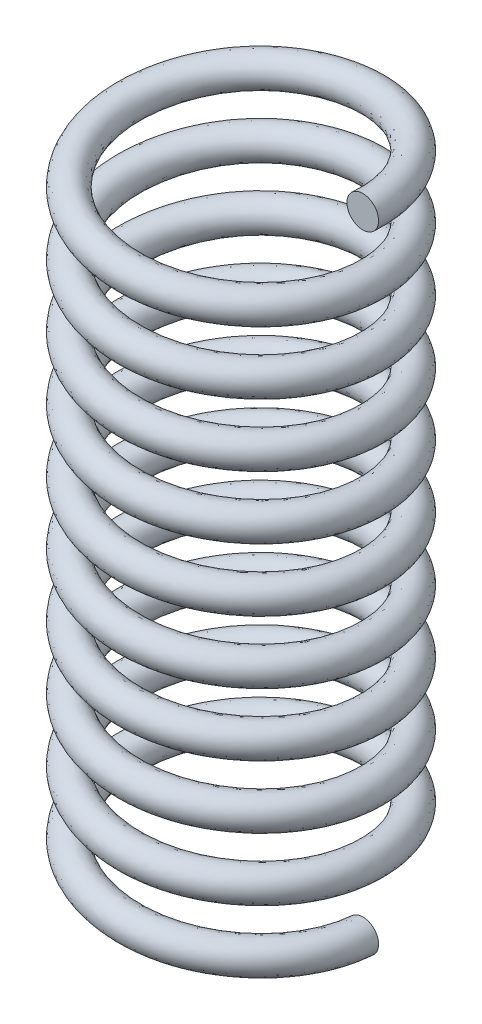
ISO-10303-21;
HEADER;
FILE_DESCRIPTION(('STEP AP214'),'2;1');
FILE_NAME('part.step','',(''),(''),'','','');
FILE_SCHEMA(('AUTOMOTIVE_DESIGN { 1 0 10303 214 1 1 1 1 }'));
ENDSEC;
DATA;
#1=APPLICATION_CONTEXT('core data for automotive mechanical design processes');
#2=APPLICATION_PROTOCOL_DEFINITION('international standard','automotive_design',2000,#1);
#3=PRODUCT_CONTEXT('',#1,'mechanical');
#4=PRODUCT('Part','Part','',(#3));
#5=PRODUCT_RELATED_PRODUCT_CATEGORY('part','',(#4));
#6=PRODUCT_DEFINITION_FORMATION('','',#4);
#7=PRODUCT_DEFINITION_CONTEXT('part definition',#1,'design');
#8=PRODUCT_DEFINITION('design','',#6,#7);
#9=PRODUCT_DEFINITION_SHAPE('','',#8);
#10=(LENGTH_UNIT() NAMED_UNIT(*) SI_UNIT(.MILLI.,.METRE.));
#11=(NAMED_UNIT(*) PLANE_ANGLE_UNIT() SI_UNIT($,.RADIAN.));
#12=(NAMED_UNIT(*) SI_UNIT($,.STERADIAN.) SOLID_ANGLE_UNIT());
#13=UNCERTAINTY_MEASURE_WITH_UNIT(LENGTH_MEASURE(1.E-05),#10,'distance_accuracy_value','');
#14=(GEOMETRIC_REPRESENTATION_CONTEXT(3) GLOBAL_UNCERTAINTY_ASSIGNED_CONTEXT((#13)) GLOBAL_UNIT_ASSIGNED_CONTEXT((#10,
#11,#12)) REPRESENTATION_CONTEXT('',''));
#15=CARTESIAN_POINT('',(0.,0.,0.));
#16=DIRECTION('',(0.,0.,1.));
#17=DIRECTION('',(1.,0.,0.));
#18=AXIS2_PLACEMENT_3D('',#15,#16,#17);
#19=CARTESIAN_POINT('',(7.7,-65.5751168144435,-1.07537625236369E-12));
#20=DIRECTION('',(1.39659253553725E-13,0.,1.));
#21=DIRECTION('',(1.,0.,-1.39659253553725E-13));
#22=AXIS2_PLACEMENT_3D('',#19,#20,#21);
#23=PLANE('',#22);
#24=CARTESIAN_POINT('',(7.7,-65.5751168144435,-1.07537625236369E-12));
#25=DIRECTION('',(1.39659253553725E-13,0.,1.));
#26=DIRECTION('',(1.,0.,-1.39659253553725E-13));
#27=AXIS2_PLACEMENT_3D('',#24,#25,#26);
#28=CIRCLE('',#27,1.);
#29=CARTESIAN_POINT('',(8.7,-65.5751168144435,-1.21503550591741E-12));
#30=VERTEX_POINT('',#29);
#31=EDGE_CURVE('E43',#30,#30,#28,.T.);
#32=ORIENTED_EDGE('',*,*,#31,.F.);
#33=EDGE_LOOP('',(#32));
#34=FACE_BOUND('',#33,.T.);
#35=ADVANCED_FACE('F37',(#34),#23,.F.);
#36=CARTESIAN_POINT('',(7.7,-25.9625973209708,0.));
#37=DIRECTION('',(0.,0.,1.));
#38=DIRECTION('',(1.,0.,0.));
#39=AXIS2_PLACEMENT_3D('',#36,#37,#38);
#40=PLANE('',#39);
#41=CARTESIAN_POINT('',(7.7,-25.9625973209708,0.));
#42=DIRECTION('',(0.,0.,1.));
#43=DIRECTION('',(1.,0.,0.));
#44=AXIS2_PLACEMENT_3D('',#41,#42,#43);
#45=CIRCLE('',#44,1.);
#46=CARTESIAN_POINT('',(8.7,-25.9625973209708,0.));
#47=VERTEX_POINT('',#46);
#48=EDGE_CURVE('E10',#47,#47,#45,.T.);
#49=ORIENTED_EDGE('',*,*,#48,.T.);
#50=EDGE_LOOP('',(#49));
#51=FACE_BOUND('',#50,.T.);
#52=ADVANCED_FACE('F52',(#51),#40,.T.);
#53=CARTESIAN_POINT('',(8.7,-65.5751168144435,-1.21503550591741E-12));
#54=CARTESIAN_POINT('',(8.7000000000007,-65.2450124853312,5.02294734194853));
#55=CARTESIAN_POINT('',(4.35000000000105,-64.9149081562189,7.53442101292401));
#56=CARTESIAN_POINT('',(1.4036172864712E-12,-64.5848038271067,10.0458946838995));
#57=CARTESIAN_POINT('',(-4.34999999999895,-64.2546994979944,7.53442101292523));
#58=CARTESIAN_POINT('',(-8.6999999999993,-63.9245951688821,5.02294734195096));
#59=CARTESIAN_POINT('',(-8.7,-63.5944908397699,1.21610094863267E-12));
#60=CARTESIAN_POINT('',(-8.70000000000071,-63.2643865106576,-5.02294734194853));
#61=CARTESIAN_POINT('',(-4.35000000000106,-62.9342821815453,-7.53442101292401));
#62=CARTESIAN_POINT('',(-1.40484755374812E-12,-62.604177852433,-10.0458946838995));
#63=CARTESIAN_POINT('',(4.34999999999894,-62.2740735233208,-7.53442101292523));
#64=CARTESIAN_POINT('',(8.6999999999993,-61.9439691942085,-5.02294734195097));
#65=CARTESIAN_POINT('',(8.7,-61.6138648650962,-1.21503550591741E-12));
#66=CARTESIAN_POINT('',(8.7000000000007,-61.283760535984,5.02294734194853));
#67=CARTESIAN_POINT('',(4.35000000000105,-60.9536562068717,7.53442101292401));
#68=CARTESIAN_POINT('',(1.4036172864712E-12,-60.6235518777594,10.0458946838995));
#69=CARTESIAN_POINT('',(-4.34999999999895,-60.2934475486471,7.53442101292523));
#70=CARTESIAN_POINT('',(-8.6999999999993,-59.9633432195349,5.02294734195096));
#71=CARTESIAN_POINT('',(-8.7,-59.6332388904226,1.21610094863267E-12));
#72=CARTESIAN_POINT('',(-8.70000000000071,-59.3031345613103,-5.02294734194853));
#73=CARTESIAN_POINT('',(-4.35000000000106,-58.973030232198,-7.53442101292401));
#74=CARTESIAN_POINT('',(-1.40484755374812E-12,-58.6429259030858,-10.0458946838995));
#75=CARTESIAN_POINT('',(4.34999999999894,-58.3128215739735,-7.53442101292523));
#76=CARTESIAN_POINT('',(8.6999999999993,-57.9827172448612,-5.02294734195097));
#77=CARTESIAN_POINT('',(8.7,-57.652612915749,-1.21503550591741E-12));
#78=CARTESIAN_POINT('',(8.7000000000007,-57.3225085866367,5.02294734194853));
#79=CARTESIAN_POINT('',(4.35000000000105,-56.9924042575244,7.53442101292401));
#80=CARTESIAN_POINT('',(1.4036172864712E-12,-56.6622999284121,10.0458946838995));
#81=CARTESIAN_POINT('',(-4.34999999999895,-56.3321955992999,7.53442101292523));
#82=CARTESIAN_POINT('',(-8.6999999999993,-56.0020912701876,5.02294734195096));
#83=CARTESIAN_POINT('',(-8.7,-55.6719869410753,1.21610094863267E-12));
#84=CARTESIAN_POINT('',(-8.70000000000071,-55.3418826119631,-5.02294734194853));
#85=CARTESIAN_POINT('',(-4.35000000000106,-55.0117782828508,-7.53442101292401));
#86=CARTESIAN_POINT('',(-1.40484755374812E-12,-54.6816739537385,-10.0458946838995));
#87=CARTESIAN_POINT('',(4.34999999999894,-54.3515696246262,-7.53442101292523));
#88=CARTESIAN_POINT('',(8.6999999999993,-54.021465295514,-5.02294734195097));
#89=CARTESIAN_POINT('',(8.7,-53.6913609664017,-1.21503550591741E-12));
#90=CARTESIAN_POINT('',(8.7000000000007,-53.3612566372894,5.02294734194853));
#91=CARTESIAN_POINT('',(4.35000000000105,-53.0311523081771,7.53442101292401));
#92=CARTESIAN_POINT('',(1.4036172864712E-12,-52.7010479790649,10.0458946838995));
#93=CARTESIAN_POINT('',(-4.34999999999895,-52.3709436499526,7.53442101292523));
#94=CARTESIAN_POINT('',(-8.6999999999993,-52.0408393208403,5.02294734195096));
#95=CARTESIAN_POINT('',(-8.7,-51.7107349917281,1.21610094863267E-12));
#96=CARTESIAN_POINT('',(-8.70000000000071,-51.3806306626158,-5.02294734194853));
#97=CARTESIAN_POINT('',(-4.35000000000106,-51.0505263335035,-7.53442101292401));
#98=CARTESIAN_POINT('',(-1.40484755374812E-12,-50.7204220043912,-10.0458946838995));
#99=CARTESIAN_POINT('',(4.34999999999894,-50.390317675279,-7.53442101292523));
#100=CARTESIAN_POINT('',(8.6999999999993,-50.0602133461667,-5.02294734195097));
#101=CARTESIAN_POINT('',(8.7,-49.7301090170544,-1.21503550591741E-12));
#102=CARTESIAN_POINT('',(8.7000000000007,-49.4000046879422,5.02294734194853));
#103=CARTESIAN_POINT('',(4.35000000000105,-49.0699003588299,7.53442101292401));
#104=CARTESIAN_POINT('',(1.4036172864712E-12,-48.7397960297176,10.0458946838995));
#105=CARTESIAN_POINT('',(-4.34999999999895,-48.4096917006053,7.53442101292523));
#106=CARTESIAN_POINT('',(-8.6999999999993,-48.0795873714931,5.02294734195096));
#107=CARTESIAN_POINT('',(-8.7,-47.7494830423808,1.21610094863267E-12));
#108=CARTESIAN_POINT('',(-8.70000000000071,-47.4193787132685,-5.02294734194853));
#109=CARTESIAN_POINT('',(-4.35000000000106,-47.0892743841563,-7.53442101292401));
#110=CARTESIAN_POINT('',(-1.40484755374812E-12,-46.759170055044,-10.0458946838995));
#111=CARTESIAN_POINT('',(4.34999999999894,-46.4290657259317,-7.53442101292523));
#112=CARTESIAN_POINT('',(8.6999999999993,-46.0989613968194,-5.02294734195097));
#113=CARTESIAN_POINT('',(8.7,-45.7688570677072,-1.21503550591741E-12));
#114=CARTESIAN_POINT('',(8.7000000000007,-45.4387527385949,5.02294734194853));
#115=CARTESIAN_POINT('',(4.35000000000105,-45.1086484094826,7.53442101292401));
#116=CARTESIAN_POINT('',(1.4036172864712E-12,-44.7785440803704,10.0458946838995));
#117=CARTESIAN_POINT('',(-4.34999999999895,-44.4484397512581,7.53442101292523));
#118=CARTESIAN_POINT('',(-8.6999999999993,-44.1183354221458,5.02294734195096));
#119=CARTESIAN_POINT('',(-8.7,-43.7882310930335,1.21610094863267E-12));
#120=CARTESIAN_POINT('',(-8.70000000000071,-43.4581267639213,-5.02294734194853));
#121=CARTESIAN_POINT('',(-4.35000000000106,-43.128022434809,-7.53442101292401));
#122=CARTESIAN_POINT('',(-1.40484755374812E-12,-42.7979181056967,-10.0458946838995));
#123=CARTESIAN_POINT('',(4.34999999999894,-42.4678137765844,-7.53442101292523));
#124=CARTESIAN_POINT('',(8.6999999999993,-42.1377094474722,-5.02294734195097));
#125=CARTESIAN_POINT('',(8.7,-41.8076051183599,-1.21503550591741E-12));
#126=CARTESIAN_POINT('',(8.7000000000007,-41.4775007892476,5.02294734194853));
#127=CARTESIAN_POINT('',(4.35000000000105,-41.1473964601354,7.53442101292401));
#128=CARTESIAN_POINT('',(1.4036172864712E-12,-40.8172921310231,10.0458946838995));
#129=CARTESIAN_POINT('',(-4.34999999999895,-40.4871878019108,7.53442101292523));
#130=CARTESIAN_POINT('',(-8.6999999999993,-40.1570834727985,5.02294734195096));
#131=CARTESIAN_POINT('',(-8.7,-39.8269791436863,1.21610094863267E-12));
#132=CARTESIAN_POINT('',(-8.70000000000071,-39.496874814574,-5.02294734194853));
#133=CARTESIAN_POINT('',(-4.35000000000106,-39.1667704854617,-7.53442101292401));
#134=CARTESIAN_POINT('',(-1.40484755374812E-12,-38.8366661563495,-10.0458946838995));
#135=CARTESIAN_POINT('',(4.34999999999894,-38.5065618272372,-7.53442101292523));
#136=CARTESIAN_POINT('',(8.6999999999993,-38.1764574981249,-5.02294734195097));
#137=CARTESIAN_POINT('',(8.7,-37.8463531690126,-1.21503550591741E-12));
#138=CARTESIAN_POINT('',(8.7000000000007,-37.5162488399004,5.02294734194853));
#139=CARTESIAN_POINT('',(4.35000000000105,-37.1861445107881,7.53442101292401));
#140=CARTESIAN_POINT('',(1.4036172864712E-12,-36.8560401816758,10.0458946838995));
#141=CARTESIAN_POINT('',(-4.34999999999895,-36.5259358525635,7.53442101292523));
#142=CARTESIAN_POINT('',(-8.6999999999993,-36.1958315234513,5.02294734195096));
#143=CARTESIAN_POINT('',(-8.7,-35.865727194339,1.21610094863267E-12));
#144=CARTESIAN_POINT('',(-8.70000000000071,-35.5356228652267,-5.02294734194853));
#145=CARTESIAN_POINT('',(-4.35000000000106,-35.2055185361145,-7.53442101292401));
#146=CARTESIAN_POINT('',(-1.40484755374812E-12,-34.8754142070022,-10.0458946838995));
#147=CARTESIAN_POINT('',(4.34999999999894,-34.5453098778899,-7.53442101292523));
#148=CARTESIAN_POINT('',(8.6999999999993,-34.2152055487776,-5.02294734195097));
#149=CARTESIAN_POINT('',(8.7,-33.8851012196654,-1.21503550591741E-12));
#150=CARTESIAN_POINT('',(8.7000000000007,-33.5549968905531,5.02294734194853));
#151=CARTESIAN_POINT('',(4.35000000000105,-33.2248925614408,7.53442101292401));
#152=CARTESIAN_POINT('',(1.4036172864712E-12,-32.8947882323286,10.0458946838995));
#153=CARTESIAN_POINT('',(-4.34999999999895,-32.5646839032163,7.53442101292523));
#154=CARTESIAN_POINT('',(-8.6999999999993,-32.234579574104,5.02294734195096));
#155=CARTESIAN_POINT('',(-8.7,-31.9044752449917,1.21610094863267E-12));
#156=CARTESIAN_POINT('',(-8.70000000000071,-31.5743709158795,-5.02294734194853));
#157=CARTESIAN_POINT('',(-4.35000000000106,-31.2442665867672,-7.53442101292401));
#158=CARTESIAN_POINT('',(-1.40484755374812E-12,-30.9141622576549,-10.0458946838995));
#159=CARTESIAN_POINT('',(4.34999999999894,-30.5840579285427,-7.53442101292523));
#160=CARTESIAN_POINT('',(8.6999999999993,-30.2539535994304,-5.02294734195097));
#161=CARTESIAN_POINT('',(8.7,-29.9238492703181,-1.21503550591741E-12));
#162=CARTESIAN_POINT('',(8.7000000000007,-29.5937449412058,5.02294734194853));
#163=CARTESIAN_POINT('',(4.35000000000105,-29.2636406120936,7.53442101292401));
#164=CARTESIAN_POINT('',(1.4036172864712E-12,-28.9335362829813,10.0458946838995));
#165=CARTESIAN_POINT('',(-4.34999999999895,-28.603431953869,7.53442101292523));
#166=CARTESIAN_POINT('',(-8.6999999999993,-28.2733276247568,5.02294734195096));
#167=CARTESIAN_POINT('',(-8.7,-27.9432232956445,1.21610094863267E-12));
#168=CARTESIAN_POINT('',(-8.70000000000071,-27.6131189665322,-5.02294734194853));
#169=CARTESIAN_POINT('',(-4.35000000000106,-27.2830146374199,-7.53442101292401));
#170=CARTESIAN_POINT('',(-1.40484755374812E-12,-26.9529103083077,-10.0458946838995));
#171=CARTESIAN_POINT('',(4.34999999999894,-26.6228059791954,-7.53442101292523));
#172=CARTESIAN_POINT('',(8.6999999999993,-26.2927016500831,-5.02294734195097));
#173=CARTESIAN_POINT('',(8.7,-25.9625973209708,-1.21503550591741E-12));
#174=CARTESIAN_POINT('',(8.7000000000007,-25.6324929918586,5.02294734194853));
#175=CARTESIAN_POINT('',(4.35000000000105,-25.3023886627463,7.53442101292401));
#176=CARTESIAN_POINT('',(1.4036172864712E-12,-24.972284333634,10.0458946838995));
#177=CARTESIAN_POINT('',(-4.34999999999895,-24.6421800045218,7.53442101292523));
#178=CARTESIAN_POINT('',(-8.6999999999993,-24.3120756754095,5.02294734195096));
#179=CARTESIAN_POINT('',(-8.7,-23.9819713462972,1.21610094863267E-12));
#180=CARTESIAN_POINT('',(-8.70000000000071,-23.6518670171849,-5.02294734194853));
#181=CARTESIAN_POINT('',(-4.35000000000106,-23.3217626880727,-7.53442101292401));
#182=CARTESIAN_POINT('',(-1.40484755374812E-12,-22.9916583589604,-10.0458946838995));
#183=CARTESIAN_POINT('',(4.34999999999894,-22.6615540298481,-7.53442101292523));
#184=CARTESIAN_POINT('',(8.6999999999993,-22.3314497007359,-5.02294734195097));
#185=CARTESIAN_POINT('',(8.7,-22.0013453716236,-1.21503550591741E-12));
#186=CARTESIAN_POINT('',(8.7,-63.5751168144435,-1.21503550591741E-12));
#187=CARTESIAN_POINT('',(8.7000000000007,-63.2450124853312,5.02294734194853));
#188=CARTESIAN_POINT('',(4.35000000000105,-62.9149081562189,7.53442101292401));
#189=CARTESIAN_POINT('',(1.4036172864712E-12,-62.5848038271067,10.0458946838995));
#190=CARTESIAN_POINT('',(-4.34999999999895,-62.2546994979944,7.53442101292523));
#191=CARTESIAN_POINT('',(-8.6999999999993,-61.9245951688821,5.02294734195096));
#192=CARTESIAN_POINT('',(-8.7,-61.5944908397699,1.21610094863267E-12));
#193=CARTESIAN_POINT('',(-8.70000000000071,-61.2643865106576,-5.02294734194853));
#194=CARTESIAN_POINT('',(-4.35000000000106,-60.9342821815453,-7.53442101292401));
#195=CARTESIAN_POINT('',(-1.40484755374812E-12,-60.604177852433,-10.0458946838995));
#196=CARTESIAN_POINT('',(4.34999999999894,-60.2740735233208,-7.53442101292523));
#197=CARTESIAN_POINT('',(8.6999999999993,-59.9439691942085,-5.02294734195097));
#198=CARTESIAN_POINT('',(8.7,-59.6138648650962,-1.21503550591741E-12));
#199=CARTESIAN_POINT('',(8.7000000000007,-59.2837605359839,5.02294734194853));
#200=CARTESIAN_POINT('',(4.35000000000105,-58.9536562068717,7.53442101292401));
#201=CARTESIAN_POINT('',(1.4036172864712E-12,-58.6235518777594,10.0458946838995));
#202=CARTESIAN_POINT('',(-4.34999999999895,-58.2934475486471,7.53442101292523));
#203=CARTESIAN_POINT('',(-8.6999999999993,-57.9633432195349,5.02294734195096));
#204=CARTESIAN_POINT('',(-8.7,-57.6332388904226,1.21610094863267E-12));
#205=CARTESIAN_POINT('',(-8.70000000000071,-57.3031345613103,-5.02294734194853));
#206=CARTESIAN_POINT('',(-4.35000000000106,-56.973030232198,-7.53442101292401));
#207=CARTESIAN_POINT('',(-1.40484755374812E-12,-56.6429259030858,-10.0458946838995));
#208=CARTESIAN_POINT('',(4.34999999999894,-56.3128215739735,-7.53442101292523));
#209=CARTESIAN_POINT('',(8.6999999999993,-55.9827172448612,-5.02294734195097));
#210=CARTESIAN_POINT('',(8.7,-55.652612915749,-1.21503550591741E-12));
#211=CARTESIAN_POINT('',(8.7000000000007,-55.3225085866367,5.02294734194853));
#212=CARTESIAN_POINT('',(4.35000000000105,-54.9924042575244,7.53442101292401));
#213=CARTESIAN_POINT('',(1.4036172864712E-12,-54.6622999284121,10.0458946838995));
#214=CARTESIAN_POINT('',(-4.34999999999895,-54.3321955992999,7.53442101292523));
#215=CARTESIAN_POINT('',(-8.6999999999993,-54.0020912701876,5.02294734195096));
#216=CARTESIAN_POINT('',(-8.7,-53.6719869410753,1.21610094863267E-12));
#217=CARTESIAN_POINT('',(-8.70000000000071,-53.3418826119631,-5.02294734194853));
#218=CARTESIAN_POINT('',(-4.35000000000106,-53.0117782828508,-7.53442101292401));
#219=CARTESIAN_POINT('',(-1.40484755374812E-12,-52.6816739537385,-10.0458946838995));
#220=CARTESIAN_POINT('',(4.34999999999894,-52.3515696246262,-7.53442101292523));
#221=CARTESIAN_POINT('',(8.6999999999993,-52.021465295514,-5.02294734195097));
#222=CARTESIAN_POINT('',(8.7,-51.6913609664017,-1.21503550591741E-12));
#223=CARTESIAN_POINT('',(8.7000000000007,-51.3612566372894,5.02294734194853));
#224=CARTESIAN_POINT('',(4.35000000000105,-51.0311523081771,7.53442101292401));
#225=CARTESIAN_POINT('',(1.4036172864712E-12,-50.7010479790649,10.0458946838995));
#226=CARTESIAN_POINT('',(-4.34999999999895,-50.3709436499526,7.53442101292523));
#227=CARTESIAN_POINT('',(-8.6999999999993,-50.0408393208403,5.02294734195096));
#228=CARTESIAN_POINT('',(-8.7,-49.7107349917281,1.21610094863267E-12));
#229=CARTESIAN_POINT('',(-8.70000000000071,-49.3806306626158,-5.02294734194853));
#230=CARTESIAN_POINT('',(-4.35000000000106,-49.0505263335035,-7.53442101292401));
#231=CARTESIAN_POINT('',(-1.40484755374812E-12,-48.7204220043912,-10.0458946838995));
#232=CARTESIAN_POINT('',(4.34999999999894,-48.390317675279,-7.53442101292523));
#233=CARTESIAN_POINT('',(8.6999999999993,-48.0602133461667,-5.02294734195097));
#234=CARTESIAN_POINT('',(8.7,-47.7301090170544,-1.21503550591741E-12));
#235=CARTESIAN_POINT('',(8.7000000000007,-47.4000046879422,5.02294734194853));
#236=CARTESIAN_POINT('',(4.35000000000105,-47.0699003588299,7.53442101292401));
#237=CARTESIAN_POINT('',(1.4036172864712E-12,-46.7397960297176,10.0458946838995));
#238=CARTESIAN_POINT('',(-4.34999999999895,-46.4096917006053,7.53442101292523));
#239=CARTESIAN_POINT('',(-8.6999999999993,-46.0795873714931,5.02294734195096));
#240=CARTESIAN_POINT('',(-8.7,-45.7494830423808,1.21610094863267E-12));
#241=CARTESIAN_POINT('',(-8.70000000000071,-45.4193787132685,-5.02294734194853));
#242=CARTESIAN_POINT('',(-4.35000000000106,-45.0892743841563,-7.53442101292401));
#243=CARTESIAN_POINT('',(-1.40484755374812E-12,-44.759170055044,-10.0458946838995));
#244=CARTESIAN_POINT('',(4.34999999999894,-44.4290657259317,-7.53442101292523));
#245=CARTESIAN_POINT('',(8.6999999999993,-44.0989613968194,-5.02294734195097));
#246=CARTESIAN_POINT('',(8.7,-43.7688570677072,-1.21503550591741E-12));
#247=CARTESIAN_POINT('',(8.7000000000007,-43.4387527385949,5.02294734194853));
#248=CARTESIAN_POINT('',(4.35000000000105,-43.1086484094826,7.53442101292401));
#249=CARTESIAN_POINT('',(1.4036172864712E-12,-42.7785440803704,10.0458946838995));
#250=CARTESIAN_POINT('',(-4.34999999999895,-42.4484397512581,7.53442101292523));
#251=CARTESIAN_POINT('',(-8.6999999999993,-42.1183354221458,5.02294734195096));
#252=CARTESIAN_POINT('',(-8.7,-41.7882310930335,1.21610094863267E-12));
#253=CARTESIAN_POINT('',(-8.70000000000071,-41.4581267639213,-5.02294734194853));
#254=CARTESIAN_POINT('',(-4.35000000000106,-41.128022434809,-7.53442101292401));
#255=CARTESIAN_POINT('',(-1.40484755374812E-12,-40.7979181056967,-10.0458946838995));
#256=CARTESIAN_POINT('',(4.34999999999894,-40.4678137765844,-7.53442101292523));
#257=CARTESIAN_POINT('',(8.6999999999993,-40.1377094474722,-5.02294734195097));
#258=CARTESIAN_POINT('',(8.7,-39.8076051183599,-1.21503550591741E-12));
#259=CARTESIAN_POINT('',(8.7000000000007,-39.4775007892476,5.02294734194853));
#260=CARTESIAN_POINT('',(4.35000000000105,-39.1473964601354,7.53442101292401));
#261=CARTESIAN_POINT('',(1.4036172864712E-12,-38.8172921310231,10.0458946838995));
#262=CARTESIAN_POINT('',(-4.34999999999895,-38.4871878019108,7.53442101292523));
#263=CARTESIAN_POINT('',(-8.6999999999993,-38.1570834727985,5.02294734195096));
#264=CARTESIAN_POINT('',(-8.7,-37.8269791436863,1.21610094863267E-12));
#265=CARTESIAN_POINT('',(-8.70000000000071,-37.496874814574,-5.02294734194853));
#266=CARTESIAN_POINT('',(-4.35000000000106,-37.1667704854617,-7.53442101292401));
#267=CARTESIAN_POINT('',(-1.40484755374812E-12,-36.8366661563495,-10.0458946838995));
#268=CARTESIAN_POINT('',(4.34999999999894,-36.5065618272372,-7.53442101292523));
#269=CARTESIAN_POINT('',(8.6999999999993,-36.1764574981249,-5.02294734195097));
#270=CARTESIAN_POINT('',(8.7,-35.8463531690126,-1.21503550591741E-12));
#271=CARTESIAN_POINT('',(8.7000000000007,-35.5162488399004,5.02294734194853));
#272=CARTESIAN_POINT('',(4.35000000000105,-35.1861445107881,7.53442101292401));
#273=CARTESIAN_POINT('',(1.4036172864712E-12,-34.8560401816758,10.0458946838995));
#274=CARTESIAN_POINT('',(-4.34999999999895,-34.5259358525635,7.53442101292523));
#275=CARTESIAN_POINT('',(-8.6999999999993,-34.1958315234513,5.02294734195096));
#276=CARTESIAN_POINT('',(-8.7,-33.865727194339,1.21610094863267E-12));
#277=CARTESIAN_POINT('',(-8.70000000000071,-33.5356228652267,-5.02294734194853));
#278=CARTESIAN_POINT('',(-4.35000000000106,-33.2055185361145,-7.53442101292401));
#279=CARTESIAN_POINT('',(-1.40484755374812E-12,-32.8754142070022,-10.0458946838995));
#280=CARTESIAN_POINT('',(4.34999999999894,-32.5453098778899,-7.53442101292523));
#281=CARTESIAN_POINT('',(8.6999999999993,-32.2152055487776,-5.02294734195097));
#282=CARTESIAN_POINT('',(8.7,-31.8851012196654,-1.21503550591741E-12));
#283=CARTESIAN_POINT('',(8.7000000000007,-31.5549968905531,5.02294734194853));
#284=CARTESIAN_POINT('',(4.35000000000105,-31.2248925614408,7.53442101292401));
#285=CARTESIAN_POINT('',(1.4036172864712E-12,-30.8947882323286,10.0458946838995));
#286=CARTESIAN_POINT('',(-4.34999999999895,-30.5646839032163,7.53442101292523));
#287=CARTESIAN_POINT('',(-8.6999999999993,-30.234579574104,5.02294734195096));
#288=CARTESIAN_POINT('',(-8.7,-29.9044752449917,1.21610094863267E-12));
#289=CARTESIAN_POINT('',(-8.70000000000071,-29.5743709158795,-5.02294734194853));
#290=CARTESIAN_POINT('',(-4.35000000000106,-29.2442665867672,-7.53442101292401));
#291=CARTESIAN_POINT('',(-1.40484755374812E-12,-28.9141622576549,-10.0458946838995));
#292=CARTESIAN_POINT('',(4.34999999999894,-28.5840579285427,-7.53442101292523));
#293=CARTESIAN_POINT('',(8.6999999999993,-28.2539535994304,-5.02294734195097));
#294=CARTESIAN_POINT('',(8.7,-27.9238492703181,-1.21503550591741E-12));
#295=CARTESIAN_POINT('',(8.7000000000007,-27.5937449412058,5.02294734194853));
#296=CARTESIAN_POINT('',(4.35000000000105,-27.2636406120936,7.53442101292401));
#297=CARTESIAN_POINT('',(1.4036172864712E-12,-26.9335362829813,10.0458946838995));
#298=CARTESIAN_POINT('',(-4.34999999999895,-26.603431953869,7.53442101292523));
#299=CARTESIAN_POINT('',(-8.6999999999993,-26.2733276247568,5.02294734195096));
#300=CARTESIAN_POINT('',(-8.7,-25.9432232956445,1.21610094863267E-12));
#301=CARTESIAN_POINT('',(-8.70000000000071,-25.6131189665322,-5.02294734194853));
#302=CARTESIAN_POINT('',(-4.35000000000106,-25.2830146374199,-7.53442101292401));
#303=CARTESIAN_POINT('',(-1.40484755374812E-12,-24.9529103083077,-10.0458946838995));
#304=CARTESIAN_POINT('',(4.34999999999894,-24.6228059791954,-7.53442101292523));
#305=CARTESIAN_POINT('',(8.6999999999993,-24.2927016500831,-5.02294734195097));
#306=CARTESIAN_POINT('',(8.7,-23.9625973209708,-1.21503550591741E-12));
#307=CARTESIAN_POINT('',(8.7000000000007,-23.6324929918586,5.02294734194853));
#308=CARTESIAN_POINT('',(4.35000000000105,-23.3023886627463,7.53442101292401));
#309=CARTESIAN_POINT('',(1.4036172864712E-12,-22.972284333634,10.0458946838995));
#310=CARTESIAN_POINT('',(-4.34999999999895,-22.6421800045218,7.53442101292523));
#311=CARTESIAN_POINT('',(-8.6999999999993,-22.3120756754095,5.02294734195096));
#312=CARTESIAN_POINT('',(-8.7,-21.9819713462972,1.21610094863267E-12));
#313=CARTESIAN_POINT('',(-8.70000000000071,-21.6518670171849,-5.02294734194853));
#314=CARTESIAN_POINT('',(-4.35000000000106,-21.3217626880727,-7.53442101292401));
#315=CARTESIAN_POINT('',(-1.40484755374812E-12,-20.9916583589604,-10.0458946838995));
#316=CARTESIAN_POINT('',(4.34999999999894,-20.6615540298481,-7.53442101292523));
#317=CARTESIAN_POINT('',(8.6999999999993,-20.3314497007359,-5.02294734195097));
#318=CARTESIAN_POINT('',(8.7,-20.0013453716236,-1.21503550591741E-12));
#319=CARTESIAN_POINT('',(6.7,-63.5751168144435,-9.35716998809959E-13));
#320=CARTESIAN_POINT('',(6.70000000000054,-63.2450124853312,3.86824680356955));
#321=CARTESIAN_POINT('',(3.35000000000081,-62.9149081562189,5.80237020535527));
#322=CARTESIAN_POINT('',(1.08094664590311E-12,-62.5848038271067,7.73649360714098));
#323=CARTESIAN_POINT('',(-3.34999999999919,-62.2546994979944,5.8023702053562));
#324=CARTESIAN_POINT('',(-6.69999999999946,-61.9245951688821,3.86824680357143));
#325=CARTESIAN_POINT('',(-6.7,-61.5944908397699,9.36537512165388E-13));
#326=CARTESIAN_POINT('',(-6.70000000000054,-61.2643865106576,-3.86824680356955));
#327=CARTESIAN_POINT('',(-3.35000000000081,-60.9342821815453,-5.80237020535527));
#328=CARTESIAN_POINT('',(-1.08189409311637E-12,-60.604177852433,-7.73649360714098));
#329=CARTESIAN_POINT('',(3.34999999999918,-60.2740735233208,-5.80237020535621));
#330=CARTESIAN_POINT('',(6.69999999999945,-59.9439691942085,-3.86824680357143));
#331=CARTESIAN_POINT('',(6.7,-59.6138648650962,-9.35716998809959E-13));
#332=CARTESIAN_POINT('',(6.70000000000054,-59.2837605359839,3.86824680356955));
#333=CARTESIAN_POINT('',(3.35000000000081,-58.9536562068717,5.80237020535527));
#334=CARTESIAN_POINT('',(1.08094664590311E-12,-58.6235518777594,7.73649360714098));
#335=CARTESIAN_POINT('',(-3.34999999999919,-58.2934475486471,5.8023702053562));
#336=CARTESIAN_POINT('',(-6.69999999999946,-57.9633432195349,3.86824680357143));
#337=CARTESIAN_POINT('',(-6.7,-57.6332388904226,9.36537512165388E-13));
#338=CARTESIAN_POINT('',(-6.70000000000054,-57.3031345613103,-3.86824680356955));
#339=CARTESIAN_POINT('',(-3.35000000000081,-56.973030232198,-5.80237020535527));
#340=CARTESIAN_POINT('',(-1.08189409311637E-12,-56.6429259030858,-7.73649360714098));
#341=CARTESIAN_POINT('',(3.34999999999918,-56.3128215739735,-5.80237020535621));
#342=CARTESIAN_POINT('',(6.69999999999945,-55.9827172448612,-3.86824680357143));
#343=CARTESIAN_POINT('',(6.7,-55.652612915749,-9.35716998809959E-13));
#344=CARTESIAN_POINT('',(6.70000000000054,-55.3225085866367,3.86824680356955));
#345=CARTESIAN_POINT('',(3.35000000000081,-54.9924042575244,5.80237020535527));
#346=CARTESIAN_POINT('',(1.08094664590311E-12,-54.6622999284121,7.73649360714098));
#347=CARTESIAN_POINT('',(-3.34999999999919,-54.3321955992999,5.8023702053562));
#348=CARTESIAN_POINT('',(-6.69999999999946,-54.0020912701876,3.86824680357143));
#349=CARTESIAN_POINT('',(-6.7,-53.6719869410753,9.36537512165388E-13));
#350=CARTESIAN_POINT('',(-6.70000000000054,-53.3418826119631,-3.86824680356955));
#351=CARTESIAN_POINT('',(-3.35000000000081,-53.0117782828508,-5.80237020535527));
#352=CARTESIAN_POINT('',(-1.08189409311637E-12,-52.6816739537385,-7.73649360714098));
#353=CARTESIAN_POINT('',(3.34999999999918,-52.3515696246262,-5.80237020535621));
#354=CARTESIAN_POINT('',(6.69999999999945,-52.021465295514,-3.86824680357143));
#355=CARTESIAN_POINT('',(6.7,-51.6913609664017,-9.35716998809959E-13));
#356=CARTESIAN_POINT('',(6.70000000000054,-51.3612566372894,3.86824680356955));
#357=CARTESIAN_POINT('',(3.35000000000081,-51.0311523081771,5.80237020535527));
#358=CARTESIAN_POINT('',(1.08094664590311E-12,-50.7010479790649,7.73649360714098));
#359=CARTESIAN_POINT('',(-3.34999999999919,-50.3709436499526,5.8023702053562));
#360=CARTESIAN_POINT('',(-6.69999999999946,-50.0408393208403,3.86824680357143));
#361=CARTESIAN_POINT('',(-6.7,-49.7107349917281,9.36537512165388E-13));
#362=CARTESIAN_POINT('',(-6.70000000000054,-49.3806306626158,-3.86824680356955));
#363=CARTESIAN_POINT('',(-3.35000000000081,-49.0505263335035,-5.80237020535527));
#364=CARTESIAN_POINT('',(-1.08189409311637E-12,-48.7204220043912,-7.73649360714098));
#365=CARTESIAN_POINT('',(3.34999999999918,-48.390317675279,-5.80237020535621));
#366=CARTESIAN_POINT('',(6.69999999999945,-48.0602133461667,-3.86824680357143));
#367=CARTESIAN_POINT('',(6.7,-47.7301090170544,-9.35716998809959E-13));
#368=CARTESIAN_POINT('',(6.70000000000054,-47.4000046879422,3.86824680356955));
#369=CARTESIAN_POINT('',(3.35000000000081,-47.0699003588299,5.80237020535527));
#370=CARTESIAN_POINT('',(1.08094664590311E-12,-46.7397960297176,7.73649360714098));
#371=CARTESIAN_POINT('',(-3.34999999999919,-46.4096917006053,5.8023702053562));
#372=CARTESIAN_POINT('',(-6.69999999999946,-46.0795873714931,3.86824680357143));
#373=CARTESIAN_POINT('',(-6.7,-45.7494830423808,9.36537512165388E-13));
#374=CARTESIAN_POINT('',(-6.70000000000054,-45.4193787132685,-3.86824680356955));
#375=CARTESIAN_POINT('',(-3.35000000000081,-45.0892743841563,-5.80237020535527));
#376=CARTESIAN_POINT('',(-1.08189409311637E-12,-44.759170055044,-7.73649360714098));
#377=CARTESIAN_POINT('',(3.34999999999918,-44.4290657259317,-5.80237020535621));
#378=CARTESIAN_POINT('',(6.69999999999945,-44.0989613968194,-3.86824680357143));
#379=CARTESIAN_POINT('',(6.7,-43.7688570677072,-9.35716998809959E-13));
#380=CARTESIAN_POINT('',(6.70000000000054,-43.4387527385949,3.86824680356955));
#381=CARTESIAN_POINT('',(3.35000000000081,-43.1086484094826,5.80237020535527));
#382=CARTESIAN_POINT('',(1.08094664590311E-12,-42.7785440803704,7.73649360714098));
#383=CARTESIAN_POINT('',(-3.34999999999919,-42.4484397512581,5.8023702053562));
#384=CARTESIAN_POINT('',(-6.69999999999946,-42.1183354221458,3.86824680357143));
#385=CARTESIAN_POINT('',(-6.7,-41.7882310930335,9.36537512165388E-13));
#386=CARTESIAN_POINT('',(-6.70000000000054,-41.4581267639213,-3.86824680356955));
#387=CARTESIAN_POINT('',(-3.35000000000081,-41.128022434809,-5.80237020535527));
#388=CARTESIAN_POINT('',(-1.08189409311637E-12,-40.7979181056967,-7.73649360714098));
#389=CARTESIAN_POINT('',(3.34999999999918,-40.4678137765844,-5.80237020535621));
#390=CARTESIAN_POINT('',(6.69999999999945,-40.1377094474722,-3.86824680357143));
#391=CARTESIAN_POINT('',(6.7,-39.8076051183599,-9.35716998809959E-13));
#392=CARTESIAN_POINT('',(6.70000000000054,-39.4775007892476,3.86824680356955));
#393=CARTESIAN_POINT('',(3.35000000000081,-39.1473964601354,5.80237020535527));
#394=CARTESIAN_POINT('',(1.08094664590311E-12,-38.8172921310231,7.73649360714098));
#395=CARTESIAN_POINT('',(-3.34999999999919,-38.4871878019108,5.8023702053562));
#396=CARTESIAN_POINT('',(-6.69999999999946,-38.1570834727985,3.86824680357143));
#397=CARTESIAN_POINT('',(-6.7,-37.8269791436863,9.36537512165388E-13));
#398=CARTESIAN_POINT('',(-6.70000000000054,-37.496874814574,-3.86824680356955));
#399=CARTESIAN_POINT('',(-3.35000000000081,-37.1667704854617,-5.80237020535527));
#400=CARTESIAN_POINT('',(-1.08189409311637E-12,-36.8366661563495,-7.73649360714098));
#401=CARTESIAN_POINT('',(3.34999999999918,-36.5065618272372,-5.80237020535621));
#402=CARTESIAN_POINT('',(6.69999999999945,-36.1764574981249,-3.86824680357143));
#403=CARTESIAN_POINT('',(6.7,-35.8463531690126,-9.35716998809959E-13));
#404=CARTESIAN_POINT('',(6.70000000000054,-35.5162488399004,3.86824680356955));
#405=CARTESIAN_POINT('',(3.35000000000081,-35.1861445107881,5.80237020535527));
#406=CARTESIAN_POINT('',(1.08094664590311E-12,-34.8560401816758,7.73649360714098));
#407=CARTESIAN_POINT('',(-3.34999999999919,-34.5259358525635,5.8023702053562));
#408=CARTESIAN_POINT('',(-6.69999999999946,-34.1958315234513,3.86824680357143));
#409=CARTESIAN_POINT('',(-6.7,-33.865727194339,9.36537512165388E-13));
#410=CARTESIAN_POINT('',(-6.70000000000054,-33.5356228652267,-3.86824680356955));
#411=CARTESIAN_POINT('',(-3.35000000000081,-33.2055185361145,-5.80237020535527));
#412=CARTESIAN_POINT('',(-1.08189409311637E-12,-32.8754142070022,-7.73649360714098));
#413=CARTESIAN_POINT('',(3.34999999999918,-32.5453098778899,-5.80237020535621));
#414=CARTESIAN_POINT('',(6.69999999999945,-32.2152055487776,-3.86824680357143));
#415=CARTESIAN_POINT('',(6.7,-31.8851012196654,-9.35716998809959E-13));
#416=CARTESIAN_POINT('',(6.70000000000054,-31.5549968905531,3.86824680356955));
#417=CARTESIAN_POINT('',(3.35000000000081,-31.2248925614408,5.80237020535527));
#418=CARTESIAN_POINT('',(1.08094664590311E-12,-30.8947882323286,7.73649360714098));
#419=CARTESIAN_POINT('',(-3.34999999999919,-30.5646839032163,5.8023702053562));
#420=CARTESIAN_POINT('',(-6.69999999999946,-30.234579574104,3.86824680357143));
#421=CARTESIAN_POINT('',(-6.7,-29.9044752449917,9.36537512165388E-13));
#422=CARTESIAN_POINT('',(-6.70000000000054,-29.5743709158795,-3.86824680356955));
#423=CARTESIAN_POINT('',(-3.35000000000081,-29.2442665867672,-5.80237020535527));
#424=CARTESIAN_POINT('',(-1.08189409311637E-12,-28.9141622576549,-7.73649360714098));
#425=CARTESIAN_POINT('',(3.34999999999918,-28.5840579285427,-5.80237020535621));
#426=CARTESIAN_POINT('',(6.69999999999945,-28.2539535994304,-3.86824680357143));
#427=CARTESIAN_POINT('',(6.7,-27.9238492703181,-9.35716998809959E-13));
#428=CARTESIAN_POINT('',(6.70000000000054,-27.5937449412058,3.86824680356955));
#429=CARTESIAN_POINT('',(3.35000000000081,-27.2636406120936,5.80237020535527));
#430=CARTESIAN_POINT('',(1.08094664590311E-12,-26.9335362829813,7.73649360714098));
#431=CARTESIAN_POINT('',(-3.34999999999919,-26.603431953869,5.8023702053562));
#432=CARTESIAN_POINT('',(-6.69999999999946,-26.2733276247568,3.86824680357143));
#433=CARTESIAN_POINT('',(-6.7,-25.9432232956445,9.36537512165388E-13));
#434=CARTESIAN_POINT('',(-6.70000000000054,-25.6131189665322,-3.86824680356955));
#435=CARTESIAN_POINT('',(-3.35000000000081,-25.2830146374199,-5.80237020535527));
#436=CARTESIAN_POINT('',(-1.08189409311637E-12,-24.9529103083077,-7.73649360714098));
#437=CARTESIAN_POINT('',(3.34999999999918,-24.6228059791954,-5.80237020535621));
#438=CARTESIAN_POINT('',(6.69999999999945,-24.2927016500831,-3.86824680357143));
#439=CARTESIAN_POINT('',(6.7,-23.9625973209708,-9.35716998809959E-13));
#440=CARTESIAN_POINT('',(6.70000000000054,-23.6324929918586,3.86824680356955));
#441=CARTESIAN_POINT('',(3.35000000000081,-23.3023886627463,5.80237020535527));
#442=CARTESIAN_POINT('',(1.08094664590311E-12,-22.972284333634,7.73649360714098));
#443=CARTESIAN_POINT('',(-3.34999999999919,-22.6421800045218,5.8023702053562));
#444=CARTESIAN_POINT('',(-6.69999999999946,-22.3120756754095,3.86824680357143));
#445=CARTESIAN_POINT('',(-6.7,-21.9819713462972,9.36537512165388E-13));
#446=CARTESIAN_POINT('',(-6.70000000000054,-21.6518670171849,-3.86824680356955));
#447=CARTESIAN_POINT('',(-3.35000000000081,-21.3217626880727,-5.80237020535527));
#448=CARTESIAN_POINT('',(-1.08189409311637E-12,-20.9916583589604,-7.73649360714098));
#449=CARTESIAN_POINT('',(3.34999999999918,-20.6615540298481,-5.80237020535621));
#450=CARTESIAN_POINT('',(6.69999999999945,-20.3314497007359,-3.86824680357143));
#451=CARTESIAN_POINT('',(6.7,-20.0013453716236,-9.35716998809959E-13));
#452=CARTESIAN_POINT('',(6.7,-65.5751168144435,-9.35716998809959E-13));
#453=CARTESIAN_POINT('',(6.70000000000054,-65.2450124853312,3.86824680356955));
#454=CARTESIAN_POINT('',(3.35000000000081,-64.9149081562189,5.80237020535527));
#455=CARTESIAN_POINT('',(1.08094664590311E-12,-64.5848038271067,7.73649360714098));
#456=CARTESIAN_POINT('',(-3.34999999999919,-64.2546994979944,5.8023702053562));
#457=CARTESIAN_POINT('',(-6.69999999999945,-63.9245951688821,3.86824680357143));
#458=CARTESIAN_POINT('',(-6.7,-63.5944908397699,9.36537512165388E-13));
#459=CARTESIAN_POINT('',(-6.70000000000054,-63.2643865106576,-3.86824680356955));
#460=CARTESIAN_POINT('',(-3.35000000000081,-62.9342821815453,-5.80237020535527));
#461=CARTESIAN_POINT('',(-1.08189409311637E-12,-62.604177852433,-7.73649360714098));
#462=CARTESIAN_POINT('',(3.34999999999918,-62.2740735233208,-5.80237020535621));
#463=CARTESIAN_POINT('',(6.69999999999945,-61.9439691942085,-3.86824680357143));
#464=CARTESIAN_POINT('',(6.7,-61.6138648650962,-9.35716998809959E-13));
#465=CARTESIAN_POINT('',(6.70000000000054,-61.283760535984,3.86824680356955));
#466=CARTESIAN_POINT('',(3.35000000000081,-60.9536562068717,5.80237020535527));
#467=CARTESIAN_POINT('',(1.08094664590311E-12,-60.6235518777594,7.73649360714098));
#468=CARTESIAN_POINT('',(-3.34999999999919,-60.2934475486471,5.8023702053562));
#469=CARTESIAN_POINT('',(-6.69999999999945,-59.9633432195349,3.86824680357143));
#470=CARTESIAN_POINT('',(-6.7,-59.6332388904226,9.36537512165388E-13));
#471=CARTESIAN_POINT('',(-6.70000000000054,-59.3031345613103,-3.86824680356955));
#472=CARTESIAN_POINT('',(-3.35000000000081,-58.973030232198,-5.80237020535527));
#473=CARTESIAN_POINT('',(-1.08189409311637E-12,-58.6429259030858,-7.73649360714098));
#474=CARTESIAN_POINT('',(3.34999999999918,-58.3128215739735,-5.80237020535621));
#475=CARTESIAN_POINT('',(6.69999999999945,-57.9827172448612,-3.86824680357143));
#476=CARTESIAN_POINT('',(6.7,-57.652612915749,-9.35716998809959E-13));
#477=CARTESIAN_POINT('',(6.70000000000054,-57.3225085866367,3.86824680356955));
#478=CARTESIAN_POINT('',(3.35000000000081,-56.9924042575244,5.80237020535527));
#479=CARTESIAN_POINT('',(1.08094664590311E-12,-56.6622999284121,7.73649360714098));
#480=CARTESIAN_POINT('',(-3.34999999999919,-56.3321955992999,5.8023702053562));
#481=CARTESIAN_POINT('',(-6.69999999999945,-56.0020912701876,3.86824680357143));
#482=CARTESIAN_POINT('',(-6.7,-55.6719869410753,9.36537512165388E-13));
#483=CARTESIAN_POINT('',(-6.70000000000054,-55.3418826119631,-3.86824680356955));
#484=CARTESIAN_POINT('',(-3.35000000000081,-55.0117782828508,-5.80237020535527));
#485=CARTESIAN_POINT('',(-1.08189409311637E-12,-54.6816739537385,-7.73649360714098));
#486=CARTESIAN_POINT('',(3.34999999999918,-54.3515696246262,-5.80237020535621));
#487=CARTESIAN_POINT('',(6.69999999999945,-54.021465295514,-3.86824680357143));
#488=CARTESIAN_POINT('',(6.7,-53.6913609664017,-9.35716998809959E-13));
#489=CARTESIAN_POINT('',(6.70000000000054,-53.3612566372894,3.86824680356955));
#490=CARTESIAN_POINT('',(3.35000000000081,-53.0311523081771,5.80237020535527));
#491=CARTESIAN_POINT('',(1.08094664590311E-12,-52.7010479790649,7.73649360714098));
#492=CARTESIAN_POINT('',(-3.34999999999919,-52.3709436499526,5.8023702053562));
#493=CARTESIAN_POINT('',(-6.69999999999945,-52.0408393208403,3.86824680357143));
#494=CARTESIAN_POINT('',(-6.7,-51.7107349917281,9.36537512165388E-13));
#495=CARTESIAN_POINT('',(-6.70000000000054,-51.3806306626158,-3.86824680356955));
#496=CARTESIAN_POINT('',(-3.35000000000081,-51.0505263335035,-5.80237020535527));
#497=CARTESIAN_POINT('',(-1.08189409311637E-12,-50.7204220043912,-7.73649360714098));
#498=CARTESIAN_POINT('',(3.34999999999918,-50.390317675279,-5.80237020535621));
#499=CARTESIAN_POINT('',(6.69999999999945,-50.0602133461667,-3.86824680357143));
#500=CARTESIAN_POINT('',(6.7,-49.7301090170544,-9.35716998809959E-13));
#501=CARTESIAN_POINT('',(6.70000000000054,-49.4000046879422,3.86824680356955));
#502=CARTESIAN_POINT('',(3.35000000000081,-49.0699003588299,5.80237020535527));
#503=CARTESIAN_POINT('',(1.08094664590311E-12,-48.7397960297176,7.73649360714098));
#504=CARTESIAN_POINT('',(-3.34999999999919,-48.4096917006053,5.8023702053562));
#505=CARTESIAN_POINT('',(-6.69999999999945,-48.0795873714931,3.86824680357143));
#506=CARTESIAN_POINT('',(-6.7,-47.7494830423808,9.36537512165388E-13));
#507=CARTESIAN_POINT('',(-6.70000000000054,-47.4193787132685,-3.86824680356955));
#508=CARTESIAN_POINT('',(-3.35000000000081,-47.0892743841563,-5.80237020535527));
#509=CARTESIAN_POINT('',(-1.08189409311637E-12,-46.759170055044,-7.73649360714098));
#510=CARTESIAN_POINT('',(3.34999999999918,-46.4290657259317,-5.80237020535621));
#511=CARTESIAN_POINT('',(6.69999999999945,-46.0989613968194,-3.86824680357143));
#512=CARTESIAN_POINT('',(6.7,-45.7688570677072,-9.35716998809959E-13));
#513=CARTESIAN_POINT('',(6.70000000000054,-45.4387527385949,3.86824680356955));
#514=CARTESIAN_POINT('',(3.35000000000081,-45.1086484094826,5.80237020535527));
#515=CARTESIAN_POINT('',(1.08094664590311E-12,-44.7785440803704,7.73649360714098));
#516=CARTESIAN_POINT('',(-3.34999999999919,-44.4484397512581,5.8023702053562));
#517=CARTESIAN_POINT('',(-6.69999999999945,-44.1183354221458,3.86824680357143));
#518=CARTESIAN_POINT('',(-6.7,-43.7882310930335,9.36537512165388E-13));
#519=CARTESIAN_POINT('',(-6.70000000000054,-43.4581267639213,-3.86824680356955));
#520=CARTESIAN_POINT('',(-3.35000000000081,-43.128022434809,-5.80237020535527));
#521=CARTESIAN_POINT('',(-1.08189409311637E-12,-42.7979181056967,-7.73649360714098));
#522=CARTESIAN_POINT('',(3.34999999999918,-42.4678137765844,-5.80237020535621));
#523=CARTESIAN_POINT('',(6.69999999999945,-42.1377094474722,-3.86824680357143));
#524=CARTESIAN_POINT('',(6.7,-41.8076051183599,-9.35716998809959E-13));
#525=CARTESIAN_POINT('',(6.70000000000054,-41.4775007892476,3.86824680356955));
#526=CARTESIAN_POINT('',(3.35000000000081,-41.1473964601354,5.80237020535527));
#527=CARTESIAN_POINT('',(1.08094664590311E-12,-40.8172921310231,7.73649360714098));
#528=CARTESIAN_POINT('',(-3.34999999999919,-40.4871878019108,5.8023702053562));
#529=CARTESIAN_POINT('',(-6.69999999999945,-40.1570834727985,3.86824680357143));
#530=CARTESIAN_POINT('',(-6.7,-39.8269791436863,9.36537512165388E-13));
#531=CARTESIAN_POINT('',(-6.70000000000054,-39.496874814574,-3.86824680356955));
#532=CARTESIAN_POINT('',(-3.35000000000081,-39.1667704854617,-5.80237020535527));
#533=CARTESIAN_POINT('',(-1.08189409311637E-12,-38.8366661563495,-7.73649360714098));
#534=CARTESIAN_POINT('',(3.34999999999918,-38.5065618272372,-5.80237020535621));
#535=CARTESIAN_POINT('',(6.69999999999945,-38.1764574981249,-3.86824680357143));
#536=CARTESIAN_POINT('',(6.7,-37.8463531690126,-9.35716998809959E-13));
#537=CARTESIAN_POINT('',(6.70000000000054,-37.5162488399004,3.86824680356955));
#538=CARTESIAN_POINT('',(3.35000000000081,-37.1861445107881,5.80237020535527));
#539=CARTESIAN_POINT('',(1.08094664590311E-12,-36.8560401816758,7.73649360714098));
#540=CARTESIAN_POINT('',(-3.34999999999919,-36.5259358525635,5.8023702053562));
#541=CARTESIAN_POINT('',(-6.69999999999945,-36.1958315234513,3.86824680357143));
#542=CARTESIAN_POINT('',(-6.7,-35.865727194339,9.36537512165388E-13));
#543=CARTESIAN_POINT('',(-6.70000000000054,-35.5356228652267,-3.86824680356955));
#544=CARTESIAN_POINT('',(-3.35000000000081,-35.2055185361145,-5.80237020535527));
#545=CARTESIAN_POINT('',(-1.08189409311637E-12,-34.8754142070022,-7.73649360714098));
#546=CARTESIAN_POINT('',(3.34999999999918,-34.5453098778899,-5.80237020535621));
#547=CARTESIAN_POINT('',(6.69999999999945,-34.2152055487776,-3.86824680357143));
#548=CARTESIAN_POINT('',(6.7,-33.8851012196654,-9.35716998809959E-13));
#549=CARTESIAN_POINT('',(6.70000000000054,-33.5549968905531,3.86824680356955));
#550=CARTESIAN_POINT('',(3.35000000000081,-33.2248925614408,5.80237020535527));
#551=CARTESIAN_POINT('',(1.08094664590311E-12,-32.8947882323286,7.73649360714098));
#552=CARTESIAN_POINT('',(-3.34999999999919,-32.5646839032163,5.8023702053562));
#553=CARTESIAN_POINT('',(-6.69999999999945,-32.234579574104,3.86824680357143));
#554=CARTESIAN_POINT('',(-6.7,-31.9044752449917,9.36537512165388E-13));
#555=CARTESIAN_POINT('',(-6.70000000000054,-31.5743709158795,-3.86824680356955));
#556=CARTESIAN_POINT('',(-3.35000000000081,-31.2442665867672,-5.80237020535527));
#557=CARTESIAN_POINT('',(-1.08189409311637E-12,-30.9141622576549,-7.73649360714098));
#558=CARTESIAN_POINT('',(3.34999999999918,-30.5840579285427,-5.80237020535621));
#559=CARTESIAN_POINT('',(6.69999999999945,-30.2539535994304,-3.86824680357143));
#560=CARTESIAN_POINT('',(6.7,-29.9238492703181,-9.35716998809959E-13));
#561=CARTESIAN_POINT('',(6.70000000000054,-29.5937449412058,3.86824680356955));
#562=CARTESIAN_POINT('',(3.35000000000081,-29.2636406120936,5.80237020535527));
#563=CARTESIAN_POINT('',(1.08094664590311E-12,-28.9335362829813,7.73649360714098));
#564=CARTESIAN_POINT('',(-3.34999999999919,-28.603431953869,5.8023702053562));
#565=CARTESIAN_POINT('',(-6.69999999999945,-28.2733276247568,3.86824680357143));
#566=CARTESIAN_POINT('',(-6.7,-27.9432232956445,9.36537512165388E-13));
#567=CARTESIAN_POINT('',(-6.70000000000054,-27.6131189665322,-3.86824680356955));
#568=CARTESIAN_POINT('',(-3.35000000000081,-27.2830146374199,-5.80237020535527));
#569=CARTESIAN_POINT('',(-1.08189409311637E-12,-26.9529103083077,-7.73649360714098));
#570=CARTESIAN_POINT('',(3.34999999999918,-26.6228059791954,-5.80237020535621));
#571=CARTESIAN_POINT('',(6.69999999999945,-26.2927016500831,-3.86824680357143));
#572=CARTESIAN_POINT('',(6.7,-25.9625973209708,-9.35716998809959E-13));
#573=CARTESIAN_POINT('',(6.70000000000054,-25.6324929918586,3.86824680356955));
#574=CARTESIAN_POINT('',(3.35000000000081,-25.3023886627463,5.80237020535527));
#575=CARTESIAN_POINT('',(1.08094664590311E-12,-24.972284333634,7.73649360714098));
#576=CARTESIAN_POINT('',(-3.34999999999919,-24.6421800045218,5.8023702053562));
#577=CARTESIAN_POINT('',(-6.69999999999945,-24.3120756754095,3.86824680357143));
#578=CARTESIAN_POINT('',(-6.7,-23.9819713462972,9.36537512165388E-13));
#579=CARTESIAN_POINT('',(-6.70000000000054,-23.6518670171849,-3.86824680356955));
#580=CARTESIAN_POINT('',(-3.35000000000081,-23.3217626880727,-5.80237020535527));
#581=CARTESIAN_POINT('',(-1.08189409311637E-12,-22.9916583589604,-7.73649360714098));
#582=CARTESIAN_POINT('',(3.34999999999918,-22.6615540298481,-5.80237020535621));
#583=CARTESIAN_POINT('',(6.69999999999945,-22.3314497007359,-3.86824680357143));
#584=CARTESIAN_POINT('',(6.7,-22.0013453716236,-9.35716998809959E-13));
#585=CARTESIAN_POINT('',(6.7,-67.5751168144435,-9.35716998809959E-13));
#586=CARTESIAN_POINT('',(6.70000000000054,-67.2450124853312,3.86824680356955));
#587=CARTESIAN_POINT('',(3.35000000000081,-66.914908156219,5.80237020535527));
#588=CARTESIAN_POINT('',(1.08094664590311E-12,-66.5848038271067,7.73649360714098));
#589=CARTESIAN_POINT('',(-3.34999999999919,-66.2546994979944,5.8023702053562));
#590=CARTESIAN_POINT('',(-6.69999999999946,-65.9245951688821,3.86824680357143));
#591=CARTESIAN_POINT('',(-6.7,-65.5944908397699,9.36537512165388E-13));
#592=CARTESIAN_POINT('',(-6.70000000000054,-65.2643865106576,-3.86824680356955));
#593=CARTESIAN_POINT('',(-3.35000000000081,-64.9342821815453,-5.80237020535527));
#594=CARTESIAN_POINT('',(-1.08189409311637E-12,-64.604177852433,-7.73649360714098));
#595=CARTESIAN_POINT('',(3.34999999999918,-64.2740735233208,-5.80237020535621));
#596=CARTESIAN_POINT('',(6.69999999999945,-63.9439691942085,-3.86824680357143));
#597=CARTESIAN_POINT('',(6.7,-63.6138648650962,-9.35716998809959E-13));
#598=CARTESIAN_POINT('',(6.70000000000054,-63.2837605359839,3.86824680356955));
#599=CARTESIAN_POINT('',(3.35000000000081,-62.9536562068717,5.80237020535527));
#600=CARTESIAN_POINT('',(1.08094664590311E-12,-62.6235518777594,7.73649360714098));
#601=CARTESIAN_POINT('',(-3.34999999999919,-62.2934475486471,5.8023702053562));
#602=CARTESIAN_POINT('',(-6.69999999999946,-61.9633432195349,3.86824680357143));
#603=CARTESIAN_POINT('',(-6.7,-61.6332388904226,9.36537512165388E-13));
#604=CARTESIAN_POINT('',(-6.70000000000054,-61.3031345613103,-3.86824680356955));
#605=CARTESIAN_POINT('',(-3.35000000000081,-60.973030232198,-5.80237020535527));
#606=CARTESIAN_POINT('',(-1.08189409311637E-12,-60.6429259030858,-7.73649360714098));
#607=CARTESIAN_POINT('',(3.34999999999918,-60.3128215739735,-5.80237020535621));
#608=CARTESIAN_POINT('',(6.69999999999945,-59.9827172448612,-3.86824680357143));
#609=CARTESIAN_POINT('',(6.7,-59.652612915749,-9.35716998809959E-13));
#610=CARTESIAN_POINT('',(6.70000000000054,-59.3225085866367,3.86824680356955));
#611=CARTESIAN_POINT('',(3.35000000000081,-58.9924042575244,5.80237020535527));
#612=CARTESIAN_POINT('',(1.08094664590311E-12,-58.6622999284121,7.73649360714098));
#613=CARTESIAN_POINT('',(-3.34999999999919,-58.3321955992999,5.8023702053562));
#614=CARTESIAN_POINT('',(-6.69999999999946,-58.0020912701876,3.86824680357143));
#615=CARTESIAN_POINT('',(-6.7,-57.6719869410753,9.36537512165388E-13));
#616=CARTESIAN_POINT('',(-6.70000000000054,-57.3418826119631,-3.86824680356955));
#617=CARTESIAN_POINT('',(-3.35000000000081,-57.0117782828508,-5.80237020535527));
#618=CARTESIAN_POINT('',(-1.08189409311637E-12,-56.6816739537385,-7.73649360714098));
#619=CARTESIAN_POINT('',(3.34999999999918,-56.3515696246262,-5.80237020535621));
#620=CARTESIAN_POINT('',(6.69999999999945,-56.021465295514,-3.86824680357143));
#621=CARTESIAN_POINT('',(6.7,-55.6913609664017,-9.35716998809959E-13));
#622=CARTESIAN_POINT('',(6.70000000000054,-55.3612566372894,3.86824680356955));
#623=CARTESIAN_POINT('',(3.35000000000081,-55.0311523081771,5.80237020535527));
#624=CARTESIAN_POINT('',(1.08094664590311E-12,-54.7010479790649,7.73649360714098));
#625=CARTESIAN_POINT('',(-3.34999999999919,-54.3709436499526,5.8023702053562));
#626=CARTESIAN_POINT('',(-6.69999999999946,-54.0408393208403,3.86824680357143));
#627=CARTESIAN_POINT('',(-6.7,-53.7107349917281,9.36537512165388E-13));
#628=CARTESIAN_POINT('',(-6.70000000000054,-53.3806306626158,-3.86824680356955));
#629=CARTESIAN_POINT('',(-3.35000000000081,-53.0505263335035,-5.80237020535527));
#630=CARTESIAN_POINT('',(-1.08189409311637E-12,-52.7204220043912,-7.73649360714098));
#631=CARTESIAN_POINT('',(3.34999999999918,-52.390317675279,-5.80237020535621));
#632=CARTESIAN_POINT('',(6.69999999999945,-52.0602133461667,-3.86824680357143));
#633=CARTESIAN_POINT('',(6.7,-51.7301090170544,-9.35716998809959E-13));
#634=CARTESIAN_POINT('',(6.70000000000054,-51.4000046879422,3.86824680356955));
#635=CARTESIAN_POINT('',(3.35000000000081,-51.0699003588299,5.80237020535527));
#636=CARTESIAN_POINT('',(1.08094664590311E-12,-50.7397960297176,7.73649360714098));
#637=CARTESIAN_POINT('',(-3.34999999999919,-50.4096917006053,5.8023702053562));
#638=CARTESIAN_POINT('',(-6.69999999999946,-50.0795873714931,3.86824680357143));
#639=CARTESIAN_POINT('',(-6.7,-49.7494830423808,9.36537512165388E-13));
#640=CARTESIAN_POINT('',(-6.70000000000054,-49.4193787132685,-3.86824680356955));
#641=CARTESIAN_POINT('',(-3.35000000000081,-49.0892743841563,-5.80237020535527));
#642=CARTESIAN_POINT('',(-1.08189409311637E-12,-48.759170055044,-7.73649360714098));
#643=CARTESIAN_POINT('',(3.34999999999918,-48.4290657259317,-5.80237020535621));
#644=CARTESIAN_POINT('',(6.69999999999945,-48.0989613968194,-3.86824680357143));
#645=CARTESIAN_POINT('',(6.7,-47.7688570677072,-9.35716998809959E-13));
#646=CARTESIAN_POINT('',(6.70000000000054,-47.4387527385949,3.86824680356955));
#647=CARTESIAN_POINT('',(3.35000000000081,-47.1086484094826,5.80237020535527));
#648=CARTESIAN_POINT('',(1.08094664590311E-12,-46.7785440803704,7.73649360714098));
#649=CARTESIAN_POINT('',(-3.34999999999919,-46.4484397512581,5.8023702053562));
#650=CARTESIAN_POINT('',(-6.69999999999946,-46.1183354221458,3.86824680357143));
#651=CARTESIAN_POINT('',(-6.7,-45.7882310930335,9.36537512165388E-13));
#652=CARTESIAN_POINT('',(-6.70000000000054,-45.4581267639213,-3.86824680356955));
#653=CARTESIAN_POINT('',(-3.35000000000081,-45.128022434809,-5.80237020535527));
#654=CARTESIAN_POINT('',(-1.08189409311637E-12,-44.7979181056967,-7.73649360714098));
#655=CARTESIAN_POINT('',(3.34999999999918,-44.4678137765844,-5.80237020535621));
#656=CARTESIAN_POINT('',(6.69999999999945,-44.1377094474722,-3.86824680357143));
#657=CARTESIAN_POINT('',(6.7,-43.8076051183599,-9.35716998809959E-13));
#658=CARTESIAN_POINT('',(6.70000000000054,-43.4775007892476,3.86824680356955));
#659=CARTESIAN_POINT('',(3.35000000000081,-43.1473964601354,5.80237020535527));
#660=CARTESIAN_POINT('',(1.08094664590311E-12,-42.8172921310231,7.73649360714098));
#661=CARTESIAN_POINT('',(-3.34999999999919,-42.4871878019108,5.8023702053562));
#662=CARTESIAN_POINT('',(-6.69999999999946,-42.1570834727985,3.86824680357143));
#663=CARTESIAN_POINT('',(-6.7,-41.8269791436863,9.36537512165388E-13));
#664=CARTESIAN_POINT('',(-6.70000000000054,-41.496874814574,-3.86824680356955));
#665=CARTESIAN_POINT('',(-3.35000000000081,-41.1667704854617,-5.80237020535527));
#666=CARTESIAN_POINT('',(-1.08189409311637E-12,-40.8366661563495,-7.73649360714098));
#667=CARTESIAN_POINT('',(3.34999999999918,-40.5065618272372,-5.80237020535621));
#668=CARTESIAN_POINT('',(6.69999999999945,-40.1764574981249,-3.86824680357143));
#669=CARTESIAN_POINT('',(6.7,-39.8463531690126,-9.35716998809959E-13));
#670=CARTESIAN_POINT('',(6.70000000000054,-39.5162488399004,3.86824680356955));
#671=CARTESIAN_POINT('',(3.35000000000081,-39.1861445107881,5.80237020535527));
#672=CARTESIAN_POINT('',(1.08094664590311E-12,-38.8560401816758,7.73649360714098));
#673=CARTESIAN_POINT('',(-3.34999999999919,-38.5259358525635,5.8023702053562));
#674=CARTESIAN_POINT('',(-6.69999999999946,-38.1958315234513,3.86824680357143));
#675=CARTESIAN_POINT('',(-6.7,-37.865727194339,9.36537512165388E-13));
#676=CARTESIAN_POINT('',(-6.70000000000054,-37.5356228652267,-3.86824680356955));
#677=CARTESIAN_POINT('',(-3.35000000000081,-37.2055185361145,-5.80237020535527));
#678=CARTESIAN_POINT('',(-1.08189409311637E-12,-36.8754142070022,-7.73649360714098));
#679=CARTESIAN_POINT('',(3.34999999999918,-36.5453098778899,-5.80237020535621));
#680=CARTESIAN_POINT('',(6.69999999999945,-36.2152055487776,-3.86824680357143));
#681=CARTESIAN_POINT('',(6.7,-35.8851012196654,-9.35716998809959E-13));
#682=CARTESIAN_POINT('',(6.70000000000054,-35.5549968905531,3.86824680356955));
#683=CARTESIAN_POINT('',(3.35000000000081,-35.2248925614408,5.80237020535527));
#684=CARTESIAN_POINT('',(1.08094664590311E-12,-34.8947882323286,7.73649360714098));
#685=CARTESIAN_POINT('',(-3.34999999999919,-34.5646839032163,5.8023702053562));
#686=CARTESIAN_POINT('',(-6.69999999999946,-34.234579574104,3.86824680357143));
#687=CARTESIAN_POINT('',(-6.7,-33.9044752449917,9.36537512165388E-13));
#688=CARTESIAN_POINT('',(-6.70000000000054,-33.5743709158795,-3.86824680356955));
#689=CARTESIAN_POINT('',(-3.35000000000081,-33.2442665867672,-5.80237020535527));
#690=CARTESIAN_POINT('',(-1.08189409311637E-12,-32.9141622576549,-7.73649360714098));
#691=CARTESIAN_POINT('',(3.34999999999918,-32.5840579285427,-5.80237020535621));
#692=CARTESIAN_POINT('',(6.69999999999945,-32.2539535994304,-3.86824680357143));
#693=CARTESIAN_POINT('',(6.7,-31.9238492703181,-9.35716998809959E-13));
#694=CARTESIAN_POINT('',(6.70000000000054,-31.5937449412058,3.86824680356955));
#695=CARTESIAN_POINT('',(3.35000000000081,-31.2636406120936,5.80237020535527));
#696=CARTESIAN_POINT('',(1.08094664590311E-12,-30.9335362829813,7.73649360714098));
#697=CARTESIAN_POINT('',(-3.34999999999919,-30.603431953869,5.8023702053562));
#698=CARTESIAN_POINT('',(-6.69999999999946,-30.2733276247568,3.86824680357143));
#699=CARTESIAN_POINT('',(-6.7,-29.9432232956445,9.36537512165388E-13));
#700=CARTESIAN_POINT('',(-6.70000000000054,-29.6131189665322,-3.86824680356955));
#701=CARTESIAN_POINT('',(-3.35000000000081,-29.2830146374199,-5.80237020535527));
#702=CARTESIAN_POINT('',(-1.08189409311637E-12,-28.9529103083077,-7.73649360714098));
#703=CARTESIAN_POINT('',(3.34999999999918,-28.6228059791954,-5.80237020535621));
#704=CARTESIAN_POINT('',(6.69999999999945,-28.2927016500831,-3.86824680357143));
#705=CARTESIAN_POINT('',(6.7,-27.9625973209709,-9.35716998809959E-13));
#706=CARTESIAN_POINT('',(6.70000000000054,-27.6324929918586,3.86824680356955));
#707=CARTESIAN_POINT('',(3.35000000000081,-27.3023886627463,5.80237020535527));
#708=CARTESIAN_POINT('',(1.08094664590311E-12,-26.972284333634,7.73649360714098));
#709=CARTESIAN_POINT('',(-3.34999999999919,-26.6421800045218,5.8023702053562));
#710=CARTESIAN_POINT('',(-6.69999999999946,-26.3120756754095,3.86824680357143));
#711=CARTESIAN_POINT('',(-6.7,-25.9819713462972,9.36537512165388E-13));
#712=CARTESIAN_POINT('',(-6.70000000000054,-25.6518670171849,-3.86824680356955));
#713=CARTESIAN_POINT('',(-3.35000000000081,-25.3217626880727,-5.80237020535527));
#714=CARTESIAN_POINT('',(-1.08189409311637E-12,-24.9916583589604,-7.73649360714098));
#715=CARTESIAN_POINT('',(3.34999999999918,-24.6615540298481,-5.80237020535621));
#716=CARTESIAN_POINT('',(6.69999999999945,-24.3314497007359,-3.86824680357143));
#717=CARTESIAN_POINT('',(6.7,-24.0013453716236,-9.35716998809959E-13));
#718=CARTESIAN_POINT('',(8.7,-67.5751168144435,-1.21503550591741E-12));
#719=CARTESIAN_POINT('',(8.7000000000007,-67.2450124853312,5.02294734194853));
#720=CARTESIAN_POINT('',(4.35000000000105,-66.914908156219,7.53442101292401));
#721=CARTESIAN_POINT('',(1.4036172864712E-12,-66.5848038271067,10.0458946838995));
#722=CARTESIAN_POINT('',(-4.34999999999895,-66.2546994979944,7.53442101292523));
#723=CARTESIAN_POINT('',(-8.6999999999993,-65.9245951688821,5.02294734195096));
#724=CARTESIAN_POINT('',(-8.7,-65.5944908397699,1.21610094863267E-12));
#725=CARTESIAN_POINT('',(-8.70000000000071,-65.2643865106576,-5.02294734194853));
#726=CARTESIAN_POINT('',(-4.35000000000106,-64.9342821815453,-7.53442101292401));
#727=CARTESIAN_POINT('',(-1.40484755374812E-12,-64.604177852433,-10.0458946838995));
#728=CARTESIAN_POINT('',(4.34999999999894,-64.2740735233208,-7.53442101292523));
#729=CARTESIAN_POINT('',(8.6999999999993,-63.9439691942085,-5.02294734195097));
#730=CARTESIAN_POINT('',(8.7,-63.6138648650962,-1.21503550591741E-12));
#731=CARTESIAN_POINT('',(8.7000000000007,-63.2837605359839,5.02294734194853));
#732=CARTESIAN_POINT('',(4.35000000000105,-62.9536562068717,7.53442101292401));
#733=CARTESIAN_POINT('',(1.4036172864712E-12,-62.6235518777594,10.0458946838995));
#734=CARTESIAN_POINT('',(-4.34999999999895,-62.2934475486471,7.53442101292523));
#735=CARTESIAN_POINT('',(-8.6999999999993,-61.9633432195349,5.02294734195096));
#736=CARTESIAN_POINT('',(-8.7,-61.6332388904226,1.21610094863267E-12));
#737=CARTESIAN_POINT('',(-8.70000000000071,-61.3031345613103,-5.02294734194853));
#738=CARTESIAN_POINT('',(-4.35000000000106,-60.973030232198,-7.53442101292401));
#739=CARTESIAN_POINT('',(-1.40484755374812E-12,-60.6429259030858,-10.0458946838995));
#740=CARTESIAN_POINT('',(4.34999999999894,-60.3128215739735,-7.53442101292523));
#741=CARTESIAN_POINT('',(8.6999999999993,-59.9827172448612,-5.02294734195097));
#742=CARTESIAN_POINT('',(8.7,-59.652612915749,-1.21503550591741E-12));
#743=CARTESIAN_POINT('',(8.7000000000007,-59.3225085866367,5.02294734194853));
#744=CARTESIAN_POINT('',(4.35000000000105,-58.9924042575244,7.53442101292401));
#745=CARTESIAN_POINT('',(1.4036172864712E-12,-58.6622999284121,10.0458946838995));
#746=CARTESIAN_POINT('',(-4.34999999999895,-58.3321955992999,7.53442101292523));
#747=CARTESIAN_POINT('',(-8.6999999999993,-58.0020912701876,5.02294734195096));
#748=CARTESIAN_POINT('',(-8.7,-57.6719869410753,1.21610094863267E-12));
#749=CARTESIAN_POINT('',(-8.70000000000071,-57.3418826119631,-5.02294734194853));
#750=CARTESIAN_POINT('',(-4.35000000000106,-57.0117782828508,-7.53442101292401));
#751=CARTESIAN_POINT('',(-1.40484755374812E-12,-56.6816739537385,-10.0458946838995));
#752=CARTESIAN_POINT('',(4.34999999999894,-56.3515696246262,-7.53442101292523));
#753=CARTESIAN_POINT('',(8.6999999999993,-56.021465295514,-5.02294734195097));
#754=CARTESIAN_POINT('',(8.7,-55.6913609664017,-1.21503550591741E-12));
#755=CARTESIAN_POINT('',(8.7000000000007,-55.3612566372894,5.02294734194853));
#756=CARTESIAN_POINT('',(4.35000000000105,-55.0311523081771,7.53442101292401));
#757=CARTESIAN_POINT('',(1.4036172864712E-12,-54.7010479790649,10.0458946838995));
#758=CARTESIAN_POINT('',(-4.34999999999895,-54.3709436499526,7.53442101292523));
#759=CARTESIAN_POINT('',(-8.6999999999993,-54.0408393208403,5.02294734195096));
#760=CARTESIAN_POINT('',(-8.7,-53.7107349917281,1.21610094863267E-12));
#761=CARTESIAN_POINT('',(-8.70000000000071,-53.3806306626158,-5.02294734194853));
#762=CARTESIAN_POINT('',(-4.35000000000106,-53.0505263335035,-7.53442101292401));
#763=CARTESIAN_POINT('',(-1.40484755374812E-12,-52.7204220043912,-10.0458946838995));
#764=CARTESIAN_POINT('',(4.34999999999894,-52.390317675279,-7.53442101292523));
#765=CARTESIAN_POINT('',(8.6999999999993,-52.0602133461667,-5.02294734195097));
#766=CARTESIAN_POINT('',(8.7,-51.7301090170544,-1.21503550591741E-12));
#767=CARTESIAN_POINT('',(8.7000000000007,-51.4000046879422,5.02294734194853));
#768=CARTESIAN_POINT('',(4.35000000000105,-51.0699003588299,7.53442101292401));
#769=CARTESIAN_POINT('',(1.4036172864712E-12,-50.7397960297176,10.0458946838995));
#770=CARTESIAN_POINT('',(-4.34999999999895,-50.4096917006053,7.53442101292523));
#771=CARTESIAN_POINT('',(-8.6999999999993,-50.0795873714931,5.02294734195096));
#772=CARTESIAN_POINT('',(-8.7,-49.7494830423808,1.21610094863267E-12));
#773=CARTESIAN_POINT('',(-8.70000000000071,-49.4193787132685,-5.02294734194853));
#774=CARTESIAN_POINT('',(-4.35000000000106,-49.0892743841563,-7.53442101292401));
#775=CARTESIAN_POINT('',(-1.40484755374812E-12,-48.759170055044,-10.0458946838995));
#776=CARTESIAN_POINT('',(4.34999999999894,-48.4290657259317,-7.53442101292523));
#777=CARTESIAN_POINT('',(8.6999999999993,-48.0989613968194,-5.02294734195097));
#778=CARTESIAN_POINT('',(8.7,-47.7688570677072,-1.21503550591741E-12));
#779=CARTESIAN_POINT('',(8.7000000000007,-47.4387527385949,5.02294734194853));
#780=CARTESIAN_POINT('',(4.35000000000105,-47.1086484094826,7.53442101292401));
#781=CARTESIAN_POINT('',(1.4036172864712E-12,-46.7785440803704,10.0458946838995));
#782=CARTESIAN_POINT('',(-4.34999999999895,-46.4484397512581,7.53442101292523));
#783=CARTESIAN_POINT('',(-8.6999999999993,-46.1183354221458,5.02294734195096));
#784=CARTESIAN_POINT('',(-8.7,-45.7882310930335,1.21610094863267E-12));
#785=CARTESIAN_POINT('',(-8.70000000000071,-45.4581267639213,-5.02294734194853));
#786=CARTESIAN_POINT('',(-4.35000000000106,-45.128022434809,-7.53442101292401));
#787=CARTESIAN_POINT('',(-1.40484755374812E-12,-44.7979181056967,-10.0458946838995));
#788=CARTESIAN_POINT('',(4.34999999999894,-44.4678137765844,-7.53442101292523));
#789=CARTESIAN_POINT('',(8.6999999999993,-44.1377094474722,-5.02294734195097));
#790=CARTESIAN_POINT('',(8.7,-43.8076051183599,-1.21503550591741E-12));
#791=CARTESIAN_POINT('',(8.7000000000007,-43.4775007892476,5.02294734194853));
#792=CARTESIAN_POINT('',(4.35000000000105,-43.1473964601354,7.53442101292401));
#793=CARTESIAN_POINT('',(1.4036172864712E-12,-42.8172921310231,10.0458946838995));
#794=CARTESIAN_POINT('',(-4.34999999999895,-42.4871878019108,7.53442101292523));
#795=CARTESIAN_POINT('',(-8.6999999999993,-42.1570834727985,5.02294734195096));
#796=CARTESIAN_POINT('',(-8.7,-41.8269791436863,1.21610094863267E-12));
#797=CARTESIAN_POINT('',(-8.70000000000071,-41.496874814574,-5.02294734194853));
#798=CARTESIAN_POINT('',(-4.35000000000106,-41.1667704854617,-7.53442101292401));
#799=CARTESIAN_POINT('',(-1.40484755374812E-12,-40.8366661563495,-10.0458946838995));
#800=CARTESIAN_POINT('',(4.34999999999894,-40.5065618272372,-7.53442101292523));
#801=CARTESIAN_POINT('',(8.6999999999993,-40.1764574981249,-5.02294734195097));
#802=CARTESIAN_POINT('',(8.7,-39.8463531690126,-1.21503550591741E-12));
#803=CARTESIAN_POINT('',(8.7000000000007,-39.5162488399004,5.02294734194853));
#804=CARTESIAN_POINT('',(4.35000000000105,-39.1861445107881,7.53442101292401));
#805=CARTESIAN_POINT('',(1.4036172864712E-12,-38.8560401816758,10.0458946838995));
#806=CARTESIAN_POINT('',(-4.34999999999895,-38.5259358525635,7.53442101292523));
#807=CARTESIAN_POINT('',(-8.6999999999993,-38.1958315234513,5.02294734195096));
#808=CARTESIAN_POINT('',(-8.7,-37.865727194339,1.21610094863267E-12));
#809=CARTESIAN_POINT('',(-8.70000000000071,-37.5356228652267,-5.02294734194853));
#810=CARTESIAN_POINT('',(-4.35000000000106,-37.2055185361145,-7.53442101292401));
#811=CARTESIAN_POINT('',(-1.40484755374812E-12,-36.8754142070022,-10.0458946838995));
#812=CARTESIAN_POINT('',(4.34999999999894,-36.5453098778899,-7.53442101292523));
#813=CARTESIAN_POINT('',(8.6999999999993,-36.2152055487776,-5.02294734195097));
#814=CARTESIAN_POINT('',(8.7,-35.8851012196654,-1.21503550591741E-12));
#815=CARTESIAN_POINT('',(8.7000000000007,-35.5549968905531,5.02294734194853));
#816=CARTESIAN_POINT('',(4.35000000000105,-35.2248925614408,7.53442101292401));
#817=CARTESIAN_POINT('',(1.4036172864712E-12,-34.8947882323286,10.0458946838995));
#818=CARTESIAN_POINT('',(-4.34999999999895,-34.5646839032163,7.53442101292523));
#819=CARTESIAN_POINT('',(-8.6999999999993,-34.234579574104,5.02294734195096));
#820=CARTESIAN_POINT('',(-8.7,-33.9044752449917,1.21610094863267E-12));
#821=CARTESIAN_POINT('',(-8.70000000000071,-33.5743709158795,-5.02294734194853));
#822=CARTESIAN_POINT('',(-4.35000000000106,-33.2442665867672,-7.53442101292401));
#823=CARTESIAN_POINT('',(-1.40484755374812E-12,-32.9141622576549,-10.0458946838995));
#824=CARTESIAN_POINT('',(4.34999999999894,-32.5840579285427,-7.53442101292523));
#825=CARTESIAN_POINT('',(8.6999999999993,-32.2539535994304,-5.02294734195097));
#826=CARTESIAN_POINT('',(8.7,-31.9238492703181,-1.21503550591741E-12));
#827=CARTESIAN_POINT('',(8.7000000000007,-31.5937449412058,5.02294734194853));
#828=CARTESIAN_POINT('',(4.35000000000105,-31.2636406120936,7.53442101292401));
#829=CARTESIAN_POINT('',(1.4036172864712E-12,-30.9335362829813,10.0458946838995));
#830=CARTESIAN_POINT('',(-4.34999999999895,-30.603431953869,7.53442101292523));
#831=CARTESIAN_POINT('',(-8.6999999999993,-30.2733276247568,5.02294734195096));
#832=CARTESIAN_POINT('',(-8.7,-29.9432232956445,1.21610094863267E-12));
#833=CARTESIAN_POINT('',(-8.70000000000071,-29.6131189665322,-5.02294734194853));
#834=CARTESIAN_POINT('',(-4.35000000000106,-29.2830146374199,-7.53442101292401));
#835=CARTESIAN_POINT('',(-1.40484755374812E-12,-28.9529103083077,-10.0458946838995));
#836=CARTESIAN_POINT('',(4.34999999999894,-28.6228059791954,-7.53442101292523));
#837=CARTESIAN_POINT('',(8.6999999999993,-28.2927016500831,-5.02294734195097));
#838=CARTESIAN_POINT('',(8.7,-27.9625973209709,-1.21503550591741E-12));
#839=CARTESIAN_POINT('',(8.7000000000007,-27.6324929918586,5.02294734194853));
#840=CARTESIAN_POINT('',(4.35000000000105,-27.3023886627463,7.53442101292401));
#841=CARTESIAN_POINT('',(1.4036172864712E-12,-26.972284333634,10.0458946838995));
#842=CARTESIAN_POINT('',(-4.34999999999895,-26.6421800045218,7.53442101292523));
#843=CARTESIAN_POINT('',(-8.6999999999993,-26.3120756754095,5.02294734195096));
#844=CARTESIAN_POINT('',(-8.7,-25.9819713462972,1.21610094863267E-12));
#845=CARTESIAN_POINT('',(-8.70000000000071,-25.6518670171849,-5.02294734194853));
#846=CARTESIAN_POINT('',(-4.35000000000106,-25.3217626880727,-7.53442101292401));
#847=CARTESIAN_POINT('',(-1.40484755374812E-12,-24.9916583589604,-10.0458946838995));
#848=CARTESIAN_POINT('',(4.34999999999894,-24.6615540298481,-7.53442101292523));
#849=CARTESIAN_POINT('',(8.6999999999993,-24.3314497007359,-5.02294734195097));
#850=CARTESIAN_POINT('',(8.7,-24.0013453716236,-1.21503550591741E-12));
#851=CARTESIAN_POINT('',(8.7,-65.5751168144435,-1.21503550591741E-12));
#852=CARTESIAN_POINT('',(8.7000000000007,-65.2450124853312,5.02294734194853));
#853=CARTESIAN_POINT('',(4.35000000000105,-64.9149081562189,7.53442101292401));
#854=CARTESIAN_POINT('',(1.4036172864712E-12,-64.5848038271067,10.0458946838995));
#855=CARTESIAN_POINT('',(-4.34999999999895,-64.2546994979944,7.53442101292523));
#856=CARTESIAN_POINT('',(-8.6999999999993,-63.9245951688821,5.02294734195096));
#857=CARTESIAN_POINT('',(-8.7,-63.5944908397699,1.21610094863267E-12));
#858=CARTESIAN_POINT('',(-8.70000000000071,-63.2643865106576,-5.02294734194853));
#859=CARTESIAN_POINT('',(-4.35000000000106,-62.9342821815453,-7.53442101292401));
#860=CARTESIAN_POINT('',(-1.40484755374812E-12,-62.604177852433,-10.0458946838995));
#861=CARTESIAN_POINT('',(4.34999999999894,-62.2740735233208,-7.53442101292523));
#862=CARTESIAN_POINT('',(8.6999999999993,-61.9439691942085,-5.02294734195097));
#863=CARTESIAN_POINT('',(8.7,-61.6138648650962,-1.21503550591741E-12));
#864=CARTESIAN_POINT('',(8.7000000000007,-61.283760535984,5.02294734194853));
#865=CARTESIAN_POINT('',(4.35000000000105,-60.9536562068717,7.53442101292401));
#866=CARTESIAN_POINT('',(1.4036172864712E-12,-60.6235518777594,10.0458946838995));
#867=CARTESIAN_POINT('',(-4.34999999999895,-60.2934475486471,7.53442101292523));
#868=CARTESIAN_POINT('',(-8.6999999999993,-59.9633432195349,5.02294734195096));
#869=CARTESIAN_POINT('',(-8.7,-59.6332388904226,1.21610094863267E-12));
#870=CARTESIAN_POINT('',(-8.70000000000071,-59.3031345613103,-5.02294734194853));
#871=CARTESIAN_POINT('',(-4.35000000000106,-58.973030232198,-7.53442101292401));
#872=CARTESIAN_POINT('',(-1.40484755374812E-12,-58.6429259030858,-10.0458946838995));
#873=CARTESIAN_POINT('',(4.34999999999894,-58.3128215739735,-7.53442101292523));
#874=CARTESIAN_POINT('',(8.6999999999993,-57.9827172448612,-5.02294734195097));
#875=CARTESIAN_POINT('',(8.7,-57.652612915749,-1.21503550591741E-12));
#876=CARTESIAN_POINT('',(8.7000000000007,-57.3225085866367,5.02294734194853));
#877=CARTESIAN_POINT('',(4.35000000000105,-56.9924042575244,7.53442101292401));
#878=CARTESIAN_POINT('',(1.4036172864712E-12,-56.6622999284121,10.0458946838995));
#879=CARTESIAN_POINT('',(-4.34999999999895,-56.3321955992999,7.53442101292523));
#880=CARTESIAN_POINT('',(-8.6999999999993,-56.0020912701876,5.02294734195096));
#881=CARTESIAN_POINT('',(-8.7,-55.6719869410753,1.21610094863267E-12));
#882=CARTESIAN_POINT('',(-8.70000000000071,-55.3418826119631,-5.02294734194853));
#883=CARTESIAN_POINT('',(-4.35000000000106,-55.0117782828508,-7.53442101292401));
#884=CARTESIAN_POINT('',(-1.40484755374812E-12,-54.6816739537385,-10.0458946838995));
#885=CARTESIAN_POINT('',(4.34999999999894,-54.3515696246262,-7.53442101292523));
#886=CARTESIAN_POINT('',(8.6999999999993,-54.021465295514,-5.02294734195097));
#887=CARTESIAN_POINT('',(8.7,-53.6913609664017,-1.21503550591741E-12));
#888=CARTESIAN_POINT('',(8.7000000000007,-53.3612566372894,5.02294734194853));
#889=CARTESIAN_POINT('',(4.35000000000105,-53.0311523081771,7.53442101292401));
#890=CARTESIAN_POINT('',(1.4036172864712E-12,-52.7010479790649,10.0458946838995));
#891=CARTESIAN_POINT('',(-4.34999999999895,-52.3709436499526,7.53442101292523));
#892=CARTESIAN_POINT('',(-8.6999999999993,-52.0408393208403,5.02294734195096));
#893=CARTESIAN_POINT('',(-8.7,-51.7107349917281,1.21610094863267E-12));
#894=CARTESIAN_POINT('',(-8.70000000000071,-51.3806306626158,-5.02294734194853));
#895=CARTESIAN_POINT('',(-4.35000000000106,-51.0505263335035,-7.53442101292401));
#896=CARTESIAN_POINT('',(-1.40484755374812E-12,-50.7204220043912,-10.0458946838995));
#897=CARTESIAN_POINT('',(4.34999999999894,-50.390317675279,-7.53442101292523));
#898=CARTESIAN_POINT('',(8.6999999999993,-50.0602133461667,-5.02294734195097));
#899=CARTESIAN_POINT('',(8.7,-49.7301090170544,-1.21503550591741E-12));
#900=CARTESIAN_POINT('',(8.7000000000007,-49.4000046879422,5.02294734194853));
#901=CARTESIAN_POINT('',(4.35000000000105,-49.0699003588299,7.53442101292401));
#902=CARTESIAN_POINT('',(1.4036172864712E-12,-48.7397960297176,10.0458946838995));
#903=CARTESIAN_POINT('',(-4.34999999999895,-48.4096917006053,7.53442101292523));
#904=CARTESIAN_POINT('',(-8.6999999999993,-48.0795873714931,5.02294734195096));
#905=CARTESIAN_POINT('',(-8.7,-47.7494830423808,1.21610094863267E-12));
#906=CARTESIAN_POINT('',(-8.70000000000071,-47.4193787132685,-5.02294734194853));
#907=CARTESIAN_POINT('',(-4.35000000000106,-47.0892743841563,-7.53442101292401));
#908=CARTESIAN_POINT('',(-1.40484755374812E-12,-46.759170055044,-10.0458946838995));
#909=CARTESIAN_POINT('',(4.34999999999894,-46.4290657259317,-7.53442101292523));
#910=CARTESIAN_POINT('',(8.6999999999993,-46.0989613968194,-5.02294734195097));
#911=CARTESIAN_POINT('',(8.7,-45.7688570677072,-1.21503550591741E-12));
#912=CARTESIAN_POINT('',(8.7000000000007,-45.4387527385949,5.02294734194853));
#913=CARTESIAN_POINT('',(4.35000000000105,-45.1086484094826,7.53442101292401));
#914=CARTESIAN_POINT('',(1.4036172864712E-12,-44.7785440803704,10.0458946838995));
#915=CARTESIAN_POINT('',(-4.34999999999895,-44.4484397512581,7.53442101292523));
#916=CARTESIAN_POINT('',(-8.6999999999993,-44.1183354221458,5.02294734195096));
#917=CARTESIAN_POINT('',(-8.7,-43.7882310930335,1.21610094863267E-12));
#918=CARTESIAN_POINT('',(-8.70000000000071,-43.4581267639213,-5.02294734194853));
#919=CARTESIAN_POINT('',(-4.35000000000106,-43.128022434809,-7.53442101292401));
#920=CARTESIAN_POINT('',(-1.40484755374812E-12,-42.7979181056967,-10.0458946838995));
#921=CARTESIAN_POINT('',(4.34999999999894,-42.4678137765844,-7.53442101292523));
#922=CARTESIAN_POINT('',(8.6999999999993,-42.1377094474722,-5.02294734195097));
#923=CARTESIAN_POINT('',(8.7,-41.8076051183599,-1.21503550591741E-12));
#924=CARTESIAN_POINT('',(8.7000000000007,-41.4775007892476,5.02294734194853));
#925=CARTESIAN_POINT('',(4.35000000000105,-41.1473964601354,7.53442101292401));
#926=CARTESIAN_POINT('',(1.4036172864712E-12,-40.8172921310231,10.0458946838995));
#927=CARTESIAN_POINT('',(-4.34999999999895,-40.4871878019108,7.53442101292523));
#928=CARTESIAN_POINT('',(-8.6999999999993,-40.1570834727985,5.02294734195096));
#929=CARTESIAN_POINT('',(-8.7,-39.8269791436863,1.21610094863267E-12));
#930=CARTESIAN_POINT('',(-8.70000000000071,-39.496874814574,-5.02294734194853));
#931=CARTESIAN_POINT('',(-4.35000000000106,-39.1667704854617,-7.53442101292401));
#932=CARTESIAN_POINT('',(-1.40484755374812E-12,-38.8366661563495,-10.0458946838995));
#933=CARTESIAN_POINT('',(4.34999999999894,-38.5065618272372,-7.53442101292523));
#934=CARTESIAN_POINT('',(8.6999999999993,-38.1764574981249,-5.02294734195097));
#935=CARTESIAN_POINT('',(8.7,-37.8463531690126,-1.21503550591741E-12));
#936=CARTESIAN_POINT('',(8.7000000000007,-37.5162488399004,5.02294734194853));
#937=CARTESIAN_POINT('',(4.35000000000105,-37.1861445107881,7.53442101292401));
#938=CARTESIAN_POINT('',(1.4036172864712E-12,-36.8560401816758,10.0458946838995));
#939=CARTESIAN_POINT('',(-4.34999999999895,-36.5259358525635,7.53442101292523));
#940=CARTESIAN_POINT('',(-8.6999999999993,-36.1958315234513,5.02294734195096));
#941=CARTESIAN_POINT('',(-8.7,-35.865727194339,1.21610094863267E-12));
#942=CARTESIAN_POINT('',(-8.70000000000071,-35.5356228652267,-5.02294734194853));
#943=CARTESIAN_POINT('',(-4.35000000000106,-35.2055185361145,-7.53442101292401));
#944=CARTESIAN_POINT('',(-1.40484755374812E-12,-34.8754142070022,-10.0458946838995));
#945=CARTESIAN_POINT('',(4.34999999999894,-34.5453098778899,-7.53442101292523));
#946=CARTESIAN_POINT('',(8.6999999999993,-34.2152055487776,-5.02294734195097));
#947=CARTESIAN_POINT('',(8.7,-33.8851012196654,-1.21503550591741E-12));
#948=CARTESIAN_POINT('',(8.7000000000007,-33.5549968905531,5.02294734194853));
#949=CARTESIAN_POINT('',(4.35000000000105,-33.2248925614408,7.53442101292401));
#950=CARTESIAN_POINT('',(1.4036172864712E-12,-32.8947882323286,10.0458946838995));
#951=CARTESIAN_POINT('',(-4.34999999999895,-32.5646839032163,7.53442101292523));
#952=CARTESIAN_POINT('',(-8.6999999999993,-32.234579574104,5.02294734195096));
#953=CARTESIAN_POINT('',(-8.7,-31.9044752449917,1.21610094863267E-12));
#954=CARTESIAN_POINT('',(-8.70000000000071,-31.5743709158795,-5.02294734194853));
#955=CARTESIAN_POINT('',(-4.35000000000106,-31.2442665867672,-7.53442101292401));
#956=CARTESIAN_POINT('',(-1.40484755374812E-12,-30.9141622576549,-10.0458946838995));
#957=CARTESIAN_POINT('',(4.34999999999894,-30.5840579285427,-7.53442101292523));
#958=CARTESIAN_POINT('',(8.6999999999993,-30.2539535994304,-5.02294734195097));
#959=CARTESIAN_POINT('',(8.7,-29.9238492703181,-1.21503550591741E-12));
#960=CARTESIAN_POINT('',(8.7000000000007,-29.5937449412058,5.02294734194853));
#961=CARTESIAN_POINT('',(4.35000000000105,-29.2636406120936,7.53442101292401));
#962=CARTESIAN_POINT('',(1.4036172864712E-12,-28.9335362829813,10.0458946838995));
#963=CARTESIAN_POINT('',(-4.34999999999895,-28.603431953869,7.53442101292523));
#964=CARTESIAN_POINT('',(-8.6999999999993,-28.2733276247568,5.02294734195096));
#965=CARTESIAN_POINT('',(-8.7,-27.9432232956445,1.21610094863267E-12));
#966=CARTESIAN_POINT('',(-8.70000000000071,-27.6131189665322,-5.02294734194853));
#967=CARTESIAN_POINT('',(-4.35000000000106,-27.2830146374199,-7.53442101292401));
#968=CARTESIAN_POINT('',(-1.40484755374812E-12,-26.9529103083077,-10.0458946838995));
#969=CARTESIAN_POINT('',(4.34999999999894,-26.6228059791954,-7.53442101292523));
#970=CARTESIAN_POINT('',(8.6999999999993,-26.2927016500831,-5.02294734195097));
#971=CARTESIAN_POINT('',(8.7,-25.9625973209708,-1.21503550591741E-12));
#972=CARTESIAN_POINT('',(8.7000000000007,-25.6324929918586,5.02294734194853));
#973=CARTESIAN_POINT('',(4.35000000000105,-25.3023886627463,7.53442101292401));
#974=CARTESIAN_POINT('',(1.4036172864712E-12,-24.972284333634,10.0458946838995));
#975=CARTESIAN_POINT('',(-4.34999999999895,-24.6421800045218,7.53442101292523));
#976=CARTESIAN_POINT('',(-8.6999999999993,-24.3120756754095,5.02294734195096));
#977=CARTESIAN_POINT('',(-8.7,-23.9819713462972,1.21610094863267E-12));
#978=CARTESIAN_POINT('',(-8.70000000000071,-23.6518670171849,-5.02294734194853));
#979=CARTESIAN_POINT('',(-4.35000000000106,-23.3217626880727,-7.53442101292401));
#980=CARTESIAN_POINT('',(-1.40484755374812E-12,-22.9916583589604,-10.0458946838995));
#981=CARTESIAN_POINT('',(4.34999999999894,-22.6615540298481,-7.53442101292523));
#982=CARTESIAN_POINT('',(8.6999999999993,-22.3314497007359,-5.02294734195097));
#983=CARTESIAN_POINT('',(8.7,-22.0013453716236,-1.21503550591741E-12));
#984=(BOUNDED_SURFACE() B_SPLINE_SURFACE(3,2,((#53,#54,#55,#56,#57,#58,#59,#60,#61,#62,#63,#64,
#65,#66,#67,#68,#69,#70,#71,#72,#73,#74,#75,#76,#77,#78,#79,#80,#81,#82,#83,#84,#85,#86,#87,#88,
#89,#90,#91,#92,#93,#94,#95,#96,#97,#98,#99,#100,#101,#102,#103,#104,#105,#106,#107,#108,#109,
#110,#111,#112,#113,#114,#115,#116,#117,#118,#119,#120,#121,#122,#123,#124,#125,#126,#127,#128,
#129,#130,#131,#132,#133,#134,#135,#136,#137,#138,#139,#140,#141,#142,#143,#144,#145,#146,#147,
#148,#149,#150,#151,#152,#153,#154,#155,#156,#157,#158,#159,#160,#161,#162,#163,#164,#165,#166,
#167,#168,#169,#170,#171,#172,#173,#174,#175,#176,#177,#178,#179,#180,#181,#182,#183,#184,#185),
(#186,#187,#188,#189,#190,#191,#192,#193,#194,#195,#196,#197,#198,#199,#200,#201,#202,#203,#204,
#205,#206,#207,#208,#209,#210,#211,#212,#213,#214,#215,#216,#217,#218,#219,#220,#221,#222,#223,
#224,#225,#226,#227,#228,#229,#230,#231,#232,#233,#234,#235,#236,#237,#238,#239,#240,#241,#242,
#243,#244,#245,#246,#247,#248,#249,#250,#251,#252,#253,#254,#255,#256,#257,#258,#259,#260,#261,
#262,#263,#264,#265,#266,#267,#268,#269,#270,#271,#272,#273,#274,#275,#276,#277,#278,#279,#280,
#281,#282,#283,#284,#285,#286,#287,#288,#289,#290,#291,#292,#293,#294,#295,#296,#297,#298,#299,
#300,#301,#302,#303,#304,#305,#306,#307,#308,#309,#310,#311,#312,#313,#314,#315,#316,#317,#318),
(#319,#320,#321,#322,#323,#324,#325,#326,#327,#328,#329,#330,#331,#332,#333,#334,#335,#336,#337,
#338,#339,#340,#341,#342,#343,#344,#345,#346,#347,#348,#349,#350,#351,#352,#353,#354,#355,#356,
#357,#358,#359,#360,#361,#362,#363,#364,#365,#366,#367,#368,#369,#370,#371,#372,#373,#374,#375,
#376,#377,#378,#379,#380,#381,#382,#383,#384,#385,#386,#387,#388,#389,#390,#391,#392,#393,#394,
#395,#396,#397,#398,#399,#400,#401,#402,#403,#404,#405,#406,#407,#408,#409,#410,#411,#412,#413,
#414,#415,#416,#417,#418,#419,#420,#421,#422,#423,#424,#425,#426,#427,#428,#429,#430,#431,#432,
#433,#434,#435,#436,#437,#438,#439,#440,#441,#442,#443,#444,#445,#446,#447,#448,#449,#450,#451),
(#452,#453,#454,#455,#456,#457,#458,#459,#460,#461,#462,#463,#464,#465,#466,#467,#468,#469,#470,
#471,#472,#473,#474,#475,#476,#477,#478,#479,#480,#481,#482,#483,#484,#485,#486,#487,#488,#489,
#490,#491,#492,#493,#494,#495,#496,#497,#498,#499,#500,#501,#502,#503,#504,#505,#506,#507,#508,
#509,#510,#511,#512,#513,#514,#515,#516,#517,#518,#519,#520,#521,#522,#523,#524,#525,#526,#527,
#528,#529,#530,#531,#532,#533,#534,#535,#536,#537,#538,#539,#540,#541,#542,#543,#544,#545,#546,
#547,#548,#549,#550,#551,#552,#553,#554,#555,#556,#557,#558,#559,#560,#561,#562,#563,#564,#565,
#566,#567,#568,#569,#570,#571,#572,#573,#574,#575,#576,#577,#578,#579,#580,#581,#582,#583,#584),
(#585,#586,#587,#588,#589,#590,#591,#592,#593,#594,#595,#596,#597,#598,#599,#600,#601,#602,#603,
#604,#605,#606,#607,#608,#609,#610,#611,#612,#613,#614,#615,#616,#617,#618,#619,#620,#621,#622,
#623,#624,#625,#626,#627,#628,#629,#630,#631,#632,#633,#634,#635,#636,#637,#638,#639,#640,#641,
#642,#643,#644,#645,#646,#647,#648,#649,#650,#651,#652,#653,#654,#655,#656,#657,#658,#659,#660,
#661,#662,#663,#664,#665,#666,#667,#668,#669,#670,#671,#672,#673,#674,#675,#676,#677,#678,#679,
#680,#681,#682,#683,#684,#685,#686,#687,#688,#689,#690,#691,#692,#693,#694,#695,#696,#697,#698,
#699,#700,#701,#702,#703,#704,#705,#706,#707,#708,#709,#710,#711,#712,#713,#714,#715,#716,#717),
(#718,#719,#720,#721,#722,#723,#724,#725,#726,#727,#728,#729,#730,#731,#732,#733,#734,#735,#736,
#737,#738,#739,#740,#741,#742,#743,#744,#745,#746,#747,#748,#749,#750,#751,#752,#753,#754,#755,
#756,#757,#758,#759,#760,#761,#762,#763,#764,#765,#766,#767,#768,#769,#770,#771,#772,#773,#774,
#775,#776,#777,#778,#779,#780,#781,#782,#783,#784,#785,#786,#787,#788,#789,#790,#791,#792,#793,
#794,#795,#796,#797,#798,#799,#800,#801,#802,#803,#804,#805,#806,#807,#808,#809,#810,#811,#812,
#813,#814,#815,#816,#817,#818,#819,#820,#821,#822,#823,#824,#825,#826,#827,#828,#829,#830,#831,
#832,#833,#834,#835,#836,#837,#838,#839,#840,#841,#842,#843,#844,#845,#846,#847,#848,#849,#850),
(#851,#852,#853,#854,#855,#856,#857,#858,#859,#860,#861,#862,#863,#864,#865,#866,#867,#868,#869,
#870,#871,#872,#873,#874,#875,#876,#877,#878,#879,#880,#881,#882,#883,#884,#885,#886,#887,#888,
#889,#890,#891,#892,#893,#894,#895,#896,#897,#898,#899,#900,#901,#902,#903,#904,#905,#906,#907,
#908,#909,#910,#911,#912,#913,#914,#915,#916,#917,#918,#919,#920,#921,#922,#923,#924,#925,#926,
#927,#928,#929,#930,#931,#932,#933,#934,#935,#936,#937,#938,#939,#940,#941,#942,#943,#944,#945,
#946,#947,#948,#949,#950,#951,#952,#953,#954,#955,#956,#957,#958,#959,#960,#961,#962,#963,#964,
#965,#966,#967,#968,#969,#970,#971,#972,#973,#974,#975,#976,#977,#978,#979,#980,#981,#982,
#983)),.UNSPECIFIED.,.T.,.F.,.F.) B_SPLINE_SURFACE_WITH_KNOTS((4,3,4),(3,2,2,2,2,2,2,2,2,2,2,2,
2,2,2,2,2,2,2,2,2,2,2,2,2,2,2,2,2,2,2,2,2,2,2,2,2,2,2,2,2,2,2,2,2,2,2,2,2,2,2,2,2,2,2,2,2,2,2,2,
2,2,2,2,2,2,3),(0.,0.5,1.),(0.,0.0151515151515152,0.0303030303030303,0.0454545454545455,
0.0606060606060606,0.0757575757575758,0.0909090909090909,0.106060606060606,0.121212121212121,
0.136363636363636,0.151515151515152,0.166666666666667,0.181818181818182,0.196969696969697,
0.212121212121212,0.227272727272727,0.242424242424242,0.257575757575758,0.272727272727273,
0.287878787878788,0.303030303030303,0.318181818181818,0.333333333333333,0.348484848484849,
0.363636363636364,0.378787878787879,0.393939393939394,0.409090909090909,0.424242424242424,
0.439393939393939,0.454545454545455,0.46969696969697,0.484848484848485,0.5,0.515151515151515,
0.53030303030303,0.545454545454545,0.560606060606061,0.575757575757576,0.590909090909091,
0.606060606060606,0.621212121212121,0.636363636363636,0.651515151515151,0.666666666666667,
0.681818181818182,0.696969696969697,0.712121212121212,0.727272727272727,0.742424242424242,
0.757575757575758,0.772727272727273,0.787878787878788,0.803030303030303,0.818181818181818,
0.833333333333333,0.848484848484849,0.863636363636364,0.878787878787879,0.893939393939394,
0.909090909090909,0.924242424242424,0.939393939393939,0.954545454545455,0.96969696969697,
0.984848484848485,1.),
.UNSPECIFIED.) GEOMETRIC_REPRESENTATION_ITEM() RATIONAL_B_SPLINE_SURFACE(((1.,0.866025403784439,
1.,0.866025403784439,1.,0.866025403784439,1.,0.866025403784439,1.,0.866025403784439,1.,
0.866025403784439,1.,0.866025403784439,1.,0.866025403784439,1.,0.866025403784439,1.,
0.866025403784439,1.,0.866025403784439,1.,0.866025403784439,1.,0.866025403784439,1.,
0.866025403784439,1.,0.866025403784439,1.,0.866025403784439,1.,0.866025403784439,1.,
0.866025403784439,1.,0.866025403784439,1.,0.866025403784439,1.,0.866025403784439,1.,
0.866025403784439,1.,0.866025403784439,1.,0.866025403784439,1.,0.866025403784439,1.,
0.866025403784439,1.,0.866025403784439,1.,0.866025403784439,1.,0.866025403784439,1.,
0.866025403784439,1.,0.866025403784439,1.,0.866025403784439,1.,0.866025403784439,1.,
0.866025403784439,1.,0.866025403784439,1.,0.866025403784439,1.,0.866025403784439,1.,
0.866025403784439,1.,0.866025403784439,1.,0.866025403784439,1.,0.866025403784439,1.,
0.866025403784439,1.,0.866025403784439,1.,0.866025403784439,1.,0.866025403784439,1.,
0.866025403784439,1.,0.866025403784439,1.,0.866025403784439,1.,0.866025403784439,1.,
0.866025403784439,1.,0.866025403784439,1.,0.866025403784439,1.,0.866025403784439,1.,
0.866025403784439,1.,0.866025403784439,1.,0.866025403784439,1.,0.866025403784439,1.,
0.866025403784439,1.,0.866025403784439,1.,0.866025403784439,1.,0.866025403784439,1.,
0.866025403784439,1.,0.866025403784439,1.,0.866025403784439,1.,0.866025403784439,1.,
0.866025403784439,1.),(0.333333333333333,0.288675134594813,0.333333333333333,0.288675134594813,
0.333333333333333,0.288675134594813,0.333333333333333,0.288675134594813,0.333333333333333,
0.288675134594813,0.333333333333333,0.288675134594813,0.333333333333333,0.288675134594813,
0.333333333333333,0.288675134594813,0.333333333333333,0.288675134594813,0.333333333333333,
0.288675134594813,0.333333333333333,0.288675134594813,0.333333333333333,0.288675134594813,
0.333333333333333,0.288675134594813,0.333333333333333,0.288675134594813,0.333333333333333,
0.288675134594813,0.333333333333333,0.288675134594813,0.333333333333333,0.288675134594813,
0.333333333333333,0.288675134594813,0.333333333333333,0.288675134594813,0.333333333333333,
0.288675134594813,0.333333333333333,0.288675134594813,0.333333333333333,0.288675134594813,
0.333333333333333,0.288675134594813,0.333333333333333,0.288675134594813,0.333333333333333,
0.288675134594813,0.333333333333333,0.288675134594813,0.333333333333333,0.288675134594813,
0.333333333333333,0.288675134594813,0.333333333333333,0.288675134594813,0.333333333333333,
0.288675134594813,0.333333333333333,0.288675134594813,0.333333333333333,0.288675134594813,
0.333333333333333,0.288675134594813,0.333333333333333,0.288675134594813,0.333333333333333,
0.288675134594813,0.333333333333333,0.288675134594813,0.333333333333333,0.288675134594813,
0.333333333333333,0.288675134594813,0.333333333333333,0.288675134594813,0.333333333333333,
0.288675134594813,0.333333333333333,0.288675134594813,0.333333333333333,0.288675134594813,
0.333333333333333,0.288675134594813,0.333333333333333,0.288675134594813,0.333333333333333,
0.288675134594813,0.333333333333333,0.288675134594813,0.333333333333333,0.288675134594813,
0.333333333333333,0.288675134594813,0.333333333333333,0.288675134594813,0.333333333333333,
0.288675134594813,0.333333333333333,0.288675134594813,0.333333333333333,0.288675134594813,
0.333333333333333,0.288675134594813,0.333333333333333,0.288675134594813,0.333333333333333,
0.288675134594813,0.333333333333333,0.288675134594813,0.333333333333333,0.288675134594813,
0.333333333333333,0.288675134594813,0.333333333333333,0.288675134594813,0.333333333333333,
0.288675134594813,0.333333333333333,0.288675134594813,0.333333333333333,0.288675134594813,
0.333333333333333,0.288675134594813,0.333333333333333,0.288675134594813,0.333333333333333,
0.288675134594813,0.333333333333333,0.288675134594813,0.333333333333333),(0.333333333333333,
0.288675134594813,0.333333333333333,0.288675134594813,0.333333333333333,0.288675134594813,
0.333333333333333,0.288675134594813,0.333333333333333,0.288675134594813,0.333333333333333,
0.288675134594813,0.333333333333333,0.288675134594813,0.333333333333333,0.288675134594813,
0.333333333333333,0.288675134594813,0.333333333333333,0.288675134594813,0.333333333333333,
0.288675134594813,0.333333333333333,0.288675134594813,0.333333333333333,0.288675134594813,
0.333333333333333,0.288675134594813,0.333333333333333,0.288675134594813,0.333333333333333,
0.288675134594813,0.333333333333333,0.288675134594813,0.333333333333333,0.288675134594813,
0.333333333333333,0.288675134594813,0.333333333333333,0.288675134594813,0.333333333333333,
0.288675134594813,0.333333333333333,0.288675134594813,0.333333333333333,0.288675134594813,
0.333333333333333,0.288675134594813,0.333333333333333,0.288675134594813,0.333333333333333,
0.288675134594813,0.333333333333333,0.288675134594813,0.333333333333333,0.288675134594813,
0.333333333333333,0.288675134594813,0.333333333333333,0.288675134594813,0.333333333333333,
0.288675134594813,0.333333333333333,0.288675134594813,0.333333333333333,0.288675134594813,
0.333333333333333,0.288675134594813,0.333333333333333,0.288675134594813,0.333333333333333,
0.288675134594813,0.333333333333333,0.288675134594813,0.333333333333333,0.288675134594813,
0.333333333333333,0.288675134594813,0.333333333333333,0.288675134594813,0.333333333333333,
0.288675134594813,0.333333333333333,0.288675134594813,0.333333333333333,0.288675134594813,
0.333333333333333,0.288675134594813,0.333333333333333,0.288675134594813,0.333333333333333,
0.288675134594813,0.333333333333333,0.288675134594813,0.333333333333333,0.288675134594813,
0.333333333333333,0.288675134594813,0.333333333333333,0.288675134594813,0.333333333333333,
0.288675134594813,0.333333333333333,0.288675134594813,0.333333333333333,0.288675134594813,
0.333333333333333,0.288675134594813,0.333333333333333,0.288675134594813,0.333333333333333,
0.288675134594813,0.333333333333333,0.288675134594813,0.333333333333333,0.288675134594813,
0.333333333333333,0.288675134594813,0.333333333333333,0.288675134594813,0.333333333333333,
0.288675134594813,0.333333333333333,0.288675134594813,0.333333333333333,0.288675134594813,
0.333333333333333,0.288675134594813,0.333333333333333,0.288675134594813,0.333333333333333,
0.288675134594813,0.333333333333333),(1.,0.866025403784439,1.,0.866025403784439,1.,
0.866025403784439,1.,0.866025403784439,1.,0.866025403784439,1.,0.866025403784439,1.,
0.866025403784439,1.,0.866025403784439,1.,0.866025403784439,1.,0.866025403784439,1.,
0.866025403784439,1.,0.866025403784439,1.,0.866025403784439,1.,0.866025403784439,1.,
0.866025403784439,1.,0.866025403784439,1.,0.866025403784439,1.,0.866025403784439,1.,
0.866025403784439,1.,0.866025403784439,1.,0.866025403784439,1.,0.866025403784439,1.,
0.866025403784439,1.,0.866025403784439,1.,0.866025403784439,1.,0.866025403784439,1.,
0.866025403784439,1.,0.866025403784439,1.,0.866025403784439,1.,0.866025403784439,1.,
0.866025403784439,1.,0.866025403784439,1.,0.866025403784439,1.,0.866025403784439,1.,
0.866025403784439,1.,0.866025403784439,1.,0.866025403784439,1.,0.866025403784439,1.,
0.866025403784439,1.,0.866025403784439,1.,0.866025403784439,1.,0.866025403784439,1.,
0.866025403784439,1.,0.866025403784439,1.,0.866025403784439,1.,0.866025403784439,1.,
0.866025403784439,1.,0.866025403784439,1.,0.866025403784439,1.,0.866025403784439,1.,
0.866025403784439,1.,0.866025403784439,1.,0.866025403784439,1.,0.866025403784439,1.,
0.866025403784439,1.,0.866025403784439,1.,0.866025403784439,1.,0.866025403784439,1.,
0.866025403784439,1.,0.866025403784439,1.,0.866025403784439,1.,0.866025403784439,1.,
0.866025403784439,1.,0.866025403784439,1.,0.866025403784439,1.,0.866025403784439,1.),
(0.333333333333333,0.288675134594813,0.333333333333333,0.288675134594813,0.333333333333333,
0.288675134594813,0.333333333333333,0.288675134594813,0.333333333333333,0.288675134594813,
0.333333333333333,0.288675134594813,0.333333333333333,0.288675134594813,0.333333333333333,
0.288675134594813,0.333333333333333,0.288675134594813,0.333333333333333,0.288675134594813,
0.333333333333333,0.288675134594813,0.333333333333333,0.288675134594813,0.333333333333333,
0.288675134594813,0.333333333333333,0.288675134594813,0.333333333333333,0.288675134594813,
0.333333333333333,0.288675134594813,0.333333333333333,0.288675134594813,0.333333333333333,
0.288675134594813,0.333333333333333,0.288675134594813,0.333333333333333,0.288675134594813,
0.333333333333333,0.288675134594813,0.333333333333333,0.288675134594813,0.333333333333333,
0.288675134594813,0.333333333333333,0.288675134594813,0.333333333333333,0.288675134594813,
0.333333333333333,0.288675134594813,0.333333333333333,0.288675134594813,0.333333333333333,
0.288675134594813,0.333333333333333,0.288675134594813,0.333333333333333,0.288675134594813,
0.333333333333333,0.288675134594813,0.333333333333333,0.288675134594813,0.333333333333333,
0.288675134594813,0.333333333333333,0.288675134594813,0.333333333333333,0.288675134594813,
0.333333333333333,0.288675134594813,0.333333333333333,0.288675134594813,0.333333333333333,
0.288675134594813,0.333333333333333,0.288675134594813,0.333333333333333,0.288675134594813,
0.333333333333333,0.288675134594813,0.333333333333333,0.288675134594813,0.333333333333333,
0.288675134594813,0.333333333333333,0.288675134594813,0.333333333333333,0.288675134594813,
0.333333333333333,0.288675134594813,0.333333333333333,0.288675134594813,0.333333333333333,
0.288675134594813,0.333333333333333,0.288675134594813,0.333333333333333,0.288675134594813,
0.333333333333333,0.288675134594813,0.333333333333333,0.288675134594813,0.333333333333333,
0.288675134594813,0.333333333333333,0.288675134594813,0.333333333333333,0.288675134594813,
0.333333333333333,0.288675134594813,0.333333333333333,0.288675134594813,0.333333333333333,
0.288675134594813,0.333333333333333,0.288675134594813,0.333333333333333,0.288675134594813,
0.333333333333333,0.288675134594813,0.333333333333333,0.288675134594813,0.333333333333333,
0.288675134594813,0.333333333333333,0.288675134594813,0.333333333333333,0.288675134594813,
0.333333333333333,0.288675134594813,0.333333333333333),(0.333333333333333,0.288675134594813,
0.333333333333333,0.288675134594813,0.333333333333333,0.288675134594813,0.333333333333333,
0.288675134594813,0.333333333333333,0.288675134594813,0.333333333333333,0.288675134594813,
0.333333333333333,0.288675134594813,0.333333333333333,0.288675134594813,0.333333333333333,
0.288675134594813,0.333333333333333,0.288675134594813,0.333333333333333,0.288675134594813,
0.333333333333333,0.288675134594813,0.333333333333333,0.288675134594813,0.333333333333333,
0.288675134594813,0.333333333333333,0.288675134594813,0.333333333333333,0.288675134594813,
0.333333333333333,0.288675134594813,0.333333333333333,0.288675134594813,0.333333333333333,
0.288675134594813,0.333333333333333,0.288675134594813,0.333333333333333,0.288675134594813,
0.333333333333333,0.288675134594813,0.333333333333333,0.288675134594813,0.333333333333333,
0.288675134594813,0.333333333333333,0.288675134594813,0.333333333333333,0.288675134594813,
0.333333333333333,0.288675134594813,0.333333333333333,0.288675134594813,0.333333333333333,
0.288675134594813,0.333333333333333,0.288675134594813,0.333333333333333,0.288675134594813,
0.333333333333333,0.288675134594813,0.333333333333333,0.288675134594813,0.333333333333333,
0.288675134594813,0.333333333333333,0.288675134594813,0.333333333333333,0.288675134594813,
0.333333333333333,0.288675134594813,0.333333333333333,0.288675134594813,0.333333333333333,
0.288675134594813,0.333333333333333,0.288675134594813,0.333333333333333,0.288675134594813,
0.333333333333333,0.288675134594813,0.333333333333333,0.288675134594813,0.333333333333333,
0.288675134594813,0.333333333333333,0.288675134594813,0.333333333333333,0.288675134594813,
0.333333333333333,0.288675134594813,0.333333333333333,0.288675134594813,0.333333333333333,
0.288675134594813,0.333333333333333,0.288675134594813,0.333333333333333,0.288675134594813,
0.333333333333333,0.288675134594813,0.333333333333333,0.288675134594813,0.333333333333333,
0.288675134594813,0.333333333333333,0.288675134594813,0.333333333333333,0.288675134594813,
0.333333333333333,0.288675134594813,0.333333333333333,0.288675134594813,0.333333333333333,
0.288675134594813,0.333333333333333,0.288675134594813,0.333333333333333,0.288675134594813,
0.333333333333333,0.288675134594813,0.333333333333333,0.288675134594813,0.333333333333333,
0.288675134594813,0.333333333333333,0.288675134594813,0.333333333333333,0.288675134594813,
0.333333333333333),(1.,0.866025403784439,1.,0.866025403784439,1.,0.866025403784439,1.,
0.866025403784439,1.,0.866025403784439,1.,0.866025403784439,1.,0.866025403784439,1.,
0.866025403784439,1.,0.866025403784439,1.,0.866025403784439,1.,0.866025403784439,1.,
0.866025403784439,1.,0.866025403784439,1.,0.866025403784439,1.,0.866025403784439,1.,
0.866025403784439,1.,0.866025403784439,1.,0.866025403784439,1.,0.866025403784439,1.,
0.866025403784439,1.,0.866025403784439,1.,0.866025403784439,1.,0.866025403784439,1.,
0.866025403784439,1.,0.866025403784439,1.,0.866025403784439,1.,0.866025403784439,1.,
0.866025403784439,1.,0.866025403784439,1.,0.866025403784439,1.,0.866025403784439,1.,
0.866025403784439,1.,0.866025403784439,1.,0.866025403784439,1.,0.866025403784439,1.,
0.866025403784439,1.,0.866025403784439,1.,0.866025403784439,1.,0.866025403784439,1.,
0.866025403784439,1.,0.866025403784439,1.,0.866025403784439,1.,0.866025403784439,1.,
0.866025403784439,1.,0.866025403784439,1.,0.866025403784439,1.,0.866025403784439,1.,
0.866025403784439,1.,0.866025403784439,1.,0.866025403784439,1.,0.866025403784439,1.,
0.866025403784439,1.,0.866025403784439,1.,0.866025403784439,1.,0.866025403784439,1.,
0.866025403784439,1.,0.866025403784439,1.,0.866025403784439,1.,0.866025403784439,1.,
0.866025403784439,1.,0.866025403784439,1.,0.866025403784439,1.,0.866025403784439,1.,
0.866025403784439,1.,0.866025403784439,1.,0.866025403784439,1.))) REPRESENTATION_ITEM('') SURFACE());
#985=ORIENTED_EDGE('',*,*,#48,.F.);
#986=EDGE_LOOP('',(#985));
#987=FACE_BOUND('',#986,.T.);
#988=ORIENTED_EDGE('',*,*,#31,.T.);
#989=EDGE_LOOP('',(#988));
#990=FACE_BOUND('',#989,.T.);
#991=ADVANCED_FACE('F49',(#987,#990),#984,.T.);
#992=CLOSED_SHELL('',(#35,#52,#991));
#993=MANIFOLD_SOLID_BREP('B2',#992);
#994=ADVANCED_BREP_SHAPE_REPRESENTATION('',(#18,#993),#14);
#995=SHAPE_DEFINITION_REPRESENTATION(#9,#994);
ENDSEC;
END-ISO-10303-21;
